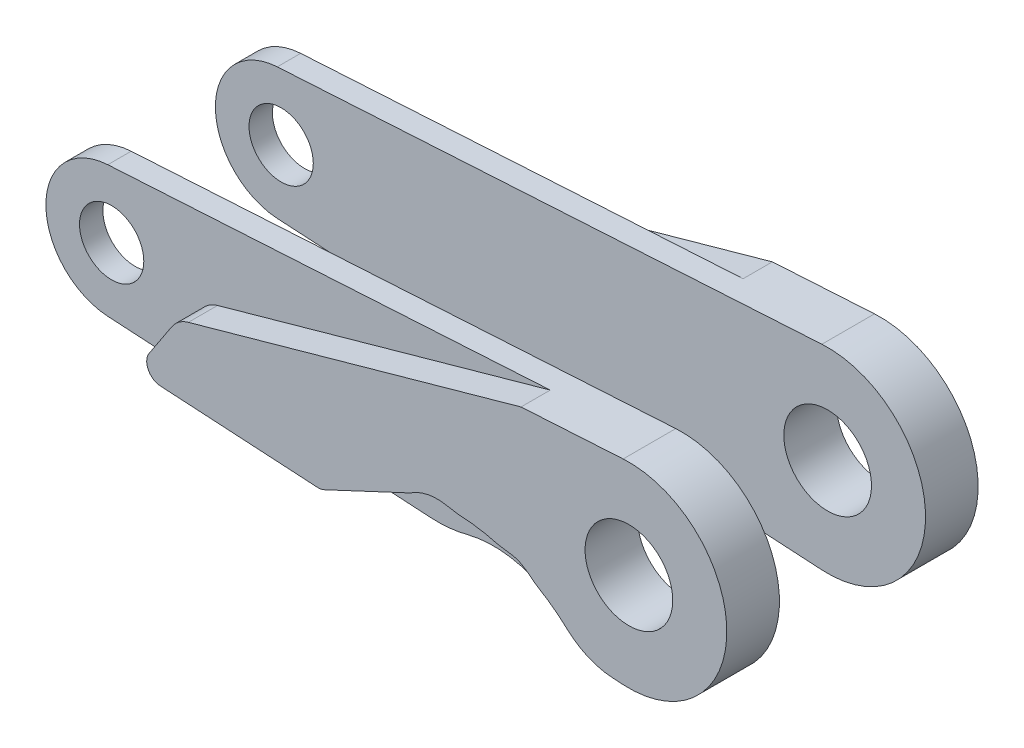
ISO-10303-21;
HEADER;
FILE_DESCRIPTION(('STEP AP214'),'2;1');
FILE_NAME('part.step','',(''),(''),'','','');
FILE_SCHEMA(('AUTOMOTIVE_DESIGN { 1 0 10303 214 1 1 1 1 }'));
ENDSEC;
DATA;
#1=APPLICATION_CONTEXT('core data for automotive mechanical design processes');
#2=APPLICATION_PROTOCOL_DEFINITION('international standard','automotive_design',2000,#1);
#3=PRODUCT_CONTEXT('',#1,'mechanical');
#4=PRODUCT('Part','Part','',(#3));
#5=PRODUCT_RELATED_PRODUCT_CATEGORY('part','',(#4));
#6=PRODUCT_DEFINITION_FORMATION('','',#4);
#7=PRODUCT_DEFINITION_CONTEXT('part definition',#1,'design');
#8=PRODUCT_DEFINITION('design','',#6,#7);
#9=PRODUCT_DEFINITION_SHAPE('','',#8);
#10=(LENGTH_UNIT() NAMED_UNIT(*) SI_UNIT(.MILLI.,.METRE.));
#11=(NAMED_UNIT(*) PLANE_ANGLE_UNIT() SI_UNIT($,.RADIAN.));
#12=(NAMED_UNIT(*) SI_UNIT($,.STERADIAN.) SOLID_ANGLE_UNIT());
#13=UNCERTAINTY_MEASURE_WITH_UNIT(LENGTH_MEASURE(1.E-05),#10,'distance_accuracy_value','');
#14=(GEOMETRIC_REPRESENTATION_CONTEXT(3) GLOBAL_UNCERTAINTY_ASSIGNED_CONTEXT((#13)) GLOBAL_UNIT_ASSIGNED_CONTEXT((#10,
#11,#12)) REPRESENTATION_CONTEXT('',''));
#15=CARTESIAN_POINT('',(0.,0.,0.));
#16=DIRECTION('',(0.,0.,1.));
#17=DIRECTION('',(1.,0.,0.));
#18=AXIS2_PLACEMENT_3D('',#15,#16,#17);
#19=CARTESIAN_POINT('',(-60.3114310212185,-68.7538061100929,113.112041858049));
#20=DIRECTION('',(0.,0.,-0.999999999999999));
#21=DIRECTION('',(1.,0.,0.));
#22=AXIS2_PLACEMENT_3D('',#19,#20,#21);
#23=CYLINDRICAL_SURFACE('',#22,57.5811728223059);
#24=CARTESIAN_POINT('',(-60.3114310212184,-68.7538061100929,-42.9999999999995));
#25=DIRECTION('',(0.,0.,0.999999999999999));
#26=DIRECTION('',(-1.,0.,0.));
#27=AXIS2_PLACEMENT_3D('',#24,#25,#26);
#28=CIRCLE('',#27,57.5811728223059);
#29=CARTESIAN_POINT('',(-44.724201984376,-13.3224994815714,-42.9999999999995));
#30=VERTEX_POINT('',#29);
#31=CARTESIAN_POINT('',(-58.1787622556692,-11.2121413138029,-42.9999999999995));
#32=VERTEX_POINT('',#31);
#33=EDGE_CURVE('P0_E232',#30,#32,#28,.T.);
#34=ORIENTED_EDGE('',*,*,#33,.F.);
#35=DIRECTION('',(0.,0.,-0.999999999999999));
#36=VECTOR('',#35,1.);
#37=CARTESIAN_POINT('',(-44.7242019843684,-13.3224994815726,-36.9999999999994));
#38=LINE('',#37,#36);
#39=CARTESIAN_POINT('',(-44.7242019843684,-13.3224994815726,-30.9999999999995));
#40=VERTEX_POINT('',#39);
#41=EDGE_CURVE('P0_E216',#40,#30,#38,.T.);
#42=ORIENTED_EDGE('',*,*,#41,.F.);
#43=CARTESIAN_POINT('',(-60.3114310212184,-68.7538061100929,-30.9999999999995));
#44=DIRECTION('',(0.,0.,0.999999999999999));
#45=DIRECTION('',(1.,0.,0.));
#46=AXIS2_PLACEMENT_3D('',#43,#44,#45);
#47=CIRCLE('',#46,57.5811728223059);
#48=CARTESIAN_POINT('',(-58.1787622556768,-11.2121413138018,-30.9999999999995));
#49=VERTEX_POINT('',#48);
#50=EDGE_CURVE('P0_E198',#49,#40,#47,.F.);
#51=ORIENTED_EDGE('',*,*,#50,.F.);
#52=DIRECTION('',(0.,0.,-0.999999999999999));
#53=VECTOR('',#52,1.);
#54=CARTESIAN_POINT('',(-58.1787622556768,-11.2121413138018,-36.9999999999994));
#55=LINE('',#54,#53);
#56=EDGE_CURVE('P0_E208',#32,#49,#55,.F.);
#57=ORIENTED_EDGE('',*,*,#56,.F.);
#58=EDGE_LOOP('',(#34,#42,#51,#57));
#59=FACE_BOUND('',#58,.T.);
#60=ADVANCED_FACE('P0_F16',(#59),#23,.F.);
#61=CARTESIAN_POINT('',(-21.1036808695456,-26.5833924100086,-42.9999999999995));
#62=VERTEX_POINT('',#61);
#63=CARTESIAN_POINT('',(-31.2037246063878,-19.0714864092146,-42.9999999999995));
#64=VERTEX_POINT('',#63);
#65=EDGE_CURVE('P0_E226',#62,#64,#28,.T.);
#66=ORIENTED_EDGE('',*,*,#65,.F.);
#67=DIRECTION('',(0.,0.,-0.999999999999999));
#68=VECTOR('',#67,1.);
#69=CARTESIAN_POINT('',(-21.1036808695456,-26.5833924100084,113.112041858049));
#70=LINE('',#69,#68);
#71=CARTESIAN_POINT('',(-21.1036808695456,-26.5833924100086,-30.9999999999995));
#72=VERTEX_POINT('',#71);
#73=EDGE_CURVE('P0_E331',#72,#62,#70,.T.);
#74=ORIENTED_EDGE('',*,*,#73,.F.);
#75=CARTESIAN_POINT('',(-31.2037246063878,-19.0714864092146,-30.9999999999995));
#76=VERTEX_POINT('',#75);
#77=EDGE_CURVE('P0_E220',#76,#72,#47,.F.);
#78=ORIENTED_EDGE('',*,*,#77,.F.);
#79=DIRECTION('',(0.,0.,-0.999999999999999));
#80=VECTOR('',#79,1.);
#81=CARTESIAN_POINT('',(-31.2037246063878,-19.0714864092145,113.112041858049));
#82=LINE('',#81,#80);
#83=EDGE_CURVE('P0_E353',#64,#76,#82,.F.);
#84=ORIENTED_EDGE('',*,*,#83,.F.);
#85=EDGE_LOOP('',(#66,#74,#78,#84));
#86=FACE_BOUND('',#85,.T.);
#87=ADVANCED_FACE('P0_F447',(#86),#23,.F.);
#88=CARTESIAN_POINT('',(-58.3200008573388,-63.,-34.9999999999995));
#89=DIRECTION('',(0.,0.,0.999999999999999));
#90=DIRECTION('',(-1.,0.,0.));
#91=AXIS2_PLACEMENT_3D('',#88,#89,#90);
#92=CYLINDRICAL_SURFACE('',#91,36.5);
#93=CARTESIAN_POINT('',(-58.3200008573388,-63.,-30.9999999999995));
#94=DIRECTION('',(0.,0.,0.999999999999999));
#95=DIRECTION('',(1.,0.,0.));
#96=AXIS2_PLACEMENT_3D('',#93,#94,#95);
#97=CIRCLE('',#96,36.5);
#98=CARTESIAN_POINT('',(-67.4390428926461,-27.6574891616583,-30.9999999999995));
#99=VERTEX_POINT('',#98);
#100=CARTESIAN_POINT('',(-45.1133238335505,-28.9730447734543,-30.9999999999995));
#101=VERTEX_POINT('',#100);
#102=EDGE_CURVE('P0_E219',#99,#101,#97,.F.);
#103=ORIENTED_EDGE('',*,*,#102,.T.);
#104=DIRECTION('',(0.,0.,0.999999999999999));
#105=VECTOR('',#104,1.);
#106=CARTESIAN_POINT('',(-45.1133238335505,-28.9730447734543,-34.9999999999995));
#107=LINE('',#106,#105);
#108=CARTESIAN_POINT('',(-45.1133238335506,-28.9730447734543,-24.9999999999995));
#109=VERTEX_POINT('',#108);
#110=EDGE_CURVE('P0_E312',#109,#101,#107,.F.);
#111=ORIENTED_EDGE('',*,*,#110,.F.);
#112=CARTESIAN_POINT('',(-58.3200008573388,-63.,-24.9999999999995));
#113=DIRECTION('',(0.,0.,-0.999999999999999));
#114=DIRECTION('',(-1.,0.,0.));
#115=AXIS2_PLACEMENT_3D('',#112,#113,#114);
#116=CIRCLE('',#115,36.5);
#117=CARTESIAN_POINT('',(-67.4390428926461,-27.6574891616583,-24.9999999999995));
#118=VERTEX_POINT('',#117);
#119=EDGE_CURVE('P0_E260',#118,#109,#116,.T.);
#120=ORIENTED_EDGE('',*,*,#119,.F.);
#121=DIRECTION('',(0.,0.,0.999999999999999));
#122=VECTOR('',#121,1.);
#123=CARTESIAN_POINT('',(-67.4390428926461,-27.6574891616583,-34.9999999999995));
#124=LINE('',#123,#122);
#125=EDGE_CURVE('P0_E315',#99,#118,#124,.T.);
#126=ORIENTED_EDGE('',*,*,#125,.F.);
#127=EDGE_LOOP('',(#103,#111,#120,#126));
#128=FACE_BOUND('',#127,.T.);
#129=ADVANCED_FACE('P0_F464',(#128),#92,.F.);
#130=CARTESIAN_POINT('',(-77.4325136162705,11.0740295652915,-34.9999999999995));
#131=DIRECTION('',(0.,0.,0.999999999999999));
#132=DIRECTION('',(-1.,0.,0.));
#133=AXIS2_PLACEMENT_3D('',#130,#131,#132);
#134=CYLINDRICAL_SURFACE('',#133,40.);
#135=ORIENTED_EDGE('',*,*,#125,.T.);
#136=CARTESIAN_POINT('',(-77.4325136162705,11.0740295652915,-24.9999999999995));
#137=DIRECTION('',(0.,0.,0.999999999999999));
#138=DIRECTION('',(1.,0.,0.));
#139=AXIS2_PLACEMENT_3D('',#136,#137,#138);
#140=CIRCLE('',#139,40.);
#141=CARTESIAN_POINT('',(-79.7854547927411,-28.8567063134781,-24.9999999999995));
#142=VERTEX_POINT('',#141);
#143=EDGE_CURVE('P0_E320',#118,#142,#140,.F.);
#144=ORIENTED_EDGE('',*,*,#143,.T.);
#145=DIRECTION('',(0.,0.,-0.999999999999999));
#146=VECTOR('',#145,1.);
#147=CARTESIAN_POINT('',(-79.785454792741,-28.8567063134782,-30.9999999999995));
#148=LINE('',#147,#146);
#149=CARTESIAN_POINT('',(-79.7854547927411,-28.8567063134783,-30.9999999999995));
#150=VERTEX_POINT('',#149);
#151=EDGE_CURVE('P0_E323',#142,#150,#148,.T.);
#152=ORIENTED_EDGE('',*,*,#151,.T.);
#153=CARTESIAN_POINT('',(-77.4325136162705,11.0740295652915,-30.9999999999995));
#154=DIRECTION('',(0.,0.,0.999999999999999));
#155=DIRECTION('',(1.,0.,0.));
#156=AXIS2_PLACEMENT_3D('',#153,#154,#155);
#157=CIRCLE('',#156,40.);
#158=EDGE_CURVE('P0_E235',#99,#150,#157,.F.);
#159=ORIENTED_EDGE('',*,*,#158,.F.);
#160=EDGE_LOOP('',(#135,#144,#152,#159));
#161=FACE_BOUND('',#160,.T.);
#162=ADVANCED_FACE('P0_F468',(#161),#134,.T.);
#163=CARTESIAN_POINT('',(-30.6402531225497,8.31676917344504,-34.9999999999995));
#164=DIRECTION('',(0.,0.,0.999999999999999));
#165=DIRECTION('',(-1.,0.,0.));
#166=AXIS2_PLACEMENT_3D('',#163,#164,#165);
#167=CYLINDRICAL_SURFACE('',#166,40.);
#168=DIRECTION('',(0.,0.,-0.999999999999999));
#169=VECTOR('',#168,1.);
#170=CARTESIAN_POINT('',(-32.9931942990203,-31.6139667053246,-24.9999999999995));
#171=LINE('',#170,#169);
#172=CARTESIAN_POINT('',(-32.9931942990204,-31.6139667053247,-30.9999999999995));
#173=VERTEX_POINT('',#172);
#174=CARTESIAN_POINT('',(-32.9931942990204,-31.6139667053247,-24.9999999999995));
#175=VERTEX_POINT('',#174);
#176=EDGE_CURVE('P0_E326',#173,#175,#171,.F.);
#177=ORIENTED_EDGE('',*,*,#176,.T.);
#178=CARTESIAN_POINT('',(-30.6402531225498,8.31676917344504,-24.9999999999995));
#179=DIRECTION('',(0.,0.,0.999999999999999));
#180=DIRECTION('',(1.,0.,0.));
#181=AXIS2_PLACEMENT_3D('',#178,#179,#180);
#182=CIRCLE('',#181,40.);
#183=EDGE_CURVE('P0_E318',#175,#109,#182,.F.);
#184=ORIENTED_EDGE('',*,*,#183,.T.);
#185=ORIENTED_EDGE('',*,*,#110,.T.);
#186=CARTESIAN_POINT('',(-30.6402531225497,8.31676917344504,-30.9999999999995));
#187=DIRECTION('',(0.,0.,0.999999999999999));
#188=DIRECTION('',(1.,0.,0.));
#189=AXIS2_PLACEMENT_3D('',#186,#187,#188);
#190=CIRCLE('',#189,40.);
#191=EDGE_CURVE('P0_E329',#173,#101,#190,.F.);
#192=ORIENTED_EDGE('',*,*,#191,.F.);
#193=EDGE_LOOP('',(#177,#184,#185,#192));
#194=FACE_BOUND('',#193,.T.);
#195=ADVANCED_FACE('P0_F458',(#194),#167,.T.);
#196=CARTESIAN_POINT('',(-1.97058823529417,-33.4419912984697,-22.9999999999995));
#197=DIRECTION('',(-0.0588235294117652,-0.998268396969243,0.));
#198=DIRECTION('',(0.998268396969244,-0.0588235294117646,0.));
#199=AXIS2_PLACEMENT_3D('',#196,#197,#198);
#200=PLANE('',#199);
#201=DIRECTION('',(-0.998268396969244,0.0588235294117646,0.));
#202=VECTOR('',#201,1.);
#203=CARTESIAN_POINT('',(-1.97058823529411,-33.4419912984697,-30.9999999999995));
#204=LINE('',#203,#202);
#205=CARTESIAN_POINT('',(-106.640171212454,-27.2742769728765,-30.9999999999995));
#206=VERTEX_POINT('',#205);
#207=EDGE_CURVE('P0_E238',#150,#206,#204,.T.);
#208=ORIENTED_EDGE('',*,*,#207,.F.);
#209=ORIENTED_EDGE('',*,*,#151,.F.);
#210=DIRECTION('',(0.998268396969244,-0.0588235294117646,0.));
#211=VECTOR('',#210,1.);
#212=CARTESIAN_POINT('',(-1.97058823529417,-33.4419912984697,-24.9999999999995));
#213=LINE('',#212,#211);
#214=CARTESIAN_POINT('',(-188.323529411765,-22.4610389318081,-24.9999999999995));
#215=VERTEX_POINT('',#214);
#216=EDGE_CURVE('P0_E304',#215,#142,#213,.T.);
#217=ORIENTED_EDGE('',*,*,#216,.F.);
#218=DIRECTION('',(0.,0.,-0.999999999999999));
#219=VECTOR('',#218,1.);
#220=CARTESIAN_POINT('',(-188.323529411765,-22.4610389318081,-22.9999999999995));
#221=LINE('',#220,#219);
#222=CARTESIAN_POINT('',(-188.323529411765,-22.4610389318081,-32.9999999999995));
#223=VERTEX_POINT('',#222);
#224=EDGE_CURVE('P0_E291',#215,#223,#221,.T.);
#225=ORIENTED_EDGE('',*,*,#224,.T.);
#226=DIRECTION('',(0.998268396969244,-0.0588235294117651,0.));
#227=VECTOR('',#226,1.);
#228=CARTESIAN_POINT('',(-188.323529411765,-22.4610389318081,-32.9999999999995));
#229=LINE('',#228,#227);
#230=CARTESIAN_POINT('',(-160.294117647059,-24.1126878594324,-32.9999999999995));
#231=VERTEX_POINT('',#230);
#232=EDGE_CURVE('P0_E229',#223,#231,#229,.T.);
#233=ORIENTED_EDGE('',*,*,#232,.T.);
#234=DIRECTION('',(0.,0.,0.999999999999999));
#235=VECTOR('',#234,1.);
#236=CARTESIAN_POINT('',(-160.294117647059,-24.1126878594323,-219.21593636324));
#237=LINE('',#236,#235);
#238=CARTESIAN_POINT('',(-160.294117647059,-24.1126878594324,-42.9999999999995));
#239=VERTEX_POINT('',#238);
#240=EDGE_CURVE('P0_E263',#239,#231,#237,.T.);
#241=ORIENTED_EDGE('',*,*,#240,.F.);
#242=DIRECTION('',(-0.998268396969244,0.0588235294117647,0.));
#243=VECTOR('',#242,1.);
#244=CARTESIAN_POINT('',(-1.97058823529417,-33.4419912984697,-42.9999999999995));
#245=LINE('',#244,#243);
#246=CARTESIAN_POINT('',(-106.640171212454,-27.2742769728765,-42.9999999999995));
#247=VERTEX_POINT('',#246);
#248=EDGE_CURVE('P0_E245',#247,#239,#245,.T.);
#249=ORIENTED_EDGE('',*,*,#248,.F.);
#250=DIRECTION('',(0.,0.,-0.999999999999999));
#251=VECTOR('',#250,1.);
#252=CARTESIAN_POINT('',(-106.640171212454,-27.2742769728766,-22.9999999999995));
#253=LINE('',#252,#251);
#254=EDGE_CURVE('P0_E379',#206,#247,#253,.T.);
#255=ORIENTED_EDGE('',*,*,#254,.F.);
#256=EDGE_LOOP('',(#208,#209,#217,#225,#233,#241,#249,#255));
#257=FACE_BOUND('',#256,.T.);
#258=ADVANCED_FACE('P0_F470',(#257),#200,.T.);
#259=CARTESIAN_POINT('',(-187.,0.,-22.9999999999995));
#260=DIRECTION('',(0.,0.,-0.999999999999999));
#261=DIRECTION('',(1.,0.,0.));
#262=AXIS2_PLACEMENT_3D('',#259,#260,#261);
#263=CYLINDRICAL_SURFACE('',#262,22.5);
#264=CARTESIAN_POINT('',(-187.,0.,-24.9999999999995));
#265=DIRECTION('',(0.,0.,0.999999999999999));
#266=DIRECTION('',(1.,0.,0.));
#267=AXIS2_PLACEMENT_3D('',#264,#265,#266);
#268=CIRCLE('',#267,22.5);
#269=CARTESIAN_POINT('',(-188.323529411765,22.461038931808,-24.9999999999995));
#270=VERTEX_POINT('',#269);
#271=EDGE_CURVE('P0_E310',#270,#215,#268,.T.);
#272=ORIENTED_EDGE('',*,*,#271,.F.);
#273=DIRECTION('',(0.,0.,-0.999999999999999));
#274=VECTOR('',#273,1.);
#275=CARTESIAN_POINT('',(-188.323529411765,22.461038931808,-22.9999999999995));
#276=LINE('',#275,#274);
#277=CARTESIAN_POINT('',(-188.323529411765,22.461038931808,-32.9999999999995));
#278=VERTEX_POINT('',#277);
#279=EDGE_CURVE('P0_E292',#270,#278,#276,.T.);
#280=ORIENTED_EDGE('',*,*,#279,.T.);
#281=CARTESIAN_POINT('',(-187.,0.,-32.9999999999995));
#282=DIRECTION('',(0.,0.,0.999999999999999));
#283=DIRECTION('',(1.,0.,0.));
#284=AXIS2_PLACEMENT_3D('',#281,#282,#283);
#285=CIRCLE('',#284,22.5);
#286=EDGE_CURVE('P0_E420',#278,#223,#285,.T.);
#287=ORIENTED_EDGE('',*,*,#286,.T.);
#288=ORIENTED_EDGE('',*,*,#224,.F.);
#289=EDGE_LOOP('',(#272,#280,#287,#288));
#290=FACE_BOUND('',#289,.T.);
#291=ADVANCED_FACE('P0_F497',(#290),#263,.T.);
#292=CARTESIAN_POINT('',(-1.97058823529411,33.4419912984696,-22.9999999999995));
#293=DIRECTION('',(-0.0588235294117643,0.998268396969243,0.));
#294=DIRECTION('',(-0.998268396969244,-0.0588235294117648,0.));
#295=AXIS2_PLACEMENT_3D('',#292,#293,#294);
#296=PLANE('',#295);
#297=ORIENTED_EDGE('',*,*,#279,.F.);
#298=DIRECTION('',(-0.998268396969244,-0.0588235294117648,0.));
#299=VECTOR('',#298,1.);
#300=CARTESIAN_POINT('',(-1.97058823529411,33.4419912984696,-24.9999999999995));
#301=LINE('',#300,#299);
#302=CARTESIAN_POINT('',(-1.97058823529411,33.4419912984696,-24.9999999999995));
#303=VERTEX_POINT('',#302);
#304=EDGE_CURVE('P0_E308',#303,#270,#301,.T.);
#305=ORIENTED_EDGE('',*,*,#304,.F.);
#306=DIRECTION('',(0.,0.,-0.999999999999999));
#307=VECTOR('',#306,1.);
#308=CARTESIAN_POINT('',(-1.97058823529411,33.4419912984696,-22.9999999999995));
#309=LINE('',#308,#307);
#310=CARTESIAN_POINT('',(-1.970588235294,33.4419912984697,-42.9999999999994));
#311=VERTEX_POINT('',#310);
#312=EDGE_CURVE('P0_E296',#303,#311,#309,.T.);
#313=ORIENTED_EDGE('',*,*,#312,.T.);
#314=DIRECTION('',(0.998268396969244,0.0588235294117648,0.));
#315=VECTOR('',#314,1.);
#316=CARTESIAN_POINT('',(-1.97058823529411,33.4419912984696,-42.9999999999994));
#317=LINE('',#316,#315);
#318=CARTESIAN_POINT('',(-36.9099821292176,31.3831677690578,-42.9999999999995));
#319=VERTEX_POINT('',#318);
#320=EDGE_CURVE('P0_E246',#319,#311,#317,.T.);
#321=ORIENTED_EDGE('',*,*,#320,.F.);
#322=DIRECTION('',(0.,0.,0.999999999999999));
#323=VECTOR('',#322,1.);
#324=CARTESIAN_POINT('',(-36.9099821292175,31.3831677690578,-219.21593636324));
#325=LINE('',#324,#323);
#326=CARTESIAN_POINT('',(-36.9099821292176,31.3831677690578,-32.9999999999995));
#327=VERTEX_POINT('',#326);
#328=EDGE_CURVE('P0_E241',#319,#327,#325,.T.);
#329=ORIENTED_EDGE('',*,*,#328,.T.);
#330=DIRECTION('',(-0.998268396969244,-0.0588235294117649,0.));
#331=VECTOR('',#330,1.);
#332=CARTESIAN_POINT('',(-36.9099821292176,31.3831677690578,-32.9999999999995));
#333=LINE('',#332,#331);
#334=EDGE_CURVE('P0_E419',#327,#278,#333,.T.);
#335=ORIENTED_EDGE('',*,*,#334,.T.);
#336=EDGE_LOOP('',(#297,#305,#313,#321,#329,#335));
#337=FACE_BOUND('',#336,.T.);
#338=ADVANCED_FACE('P0_F487',(#337),#296,.T.);
#339=CARTESIAN_POINT('',(0.,0.,-22.9999999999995));
#340=DIRECTION('',(0.,0.,-0.999999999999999));
#341=DIRECTION('',(1.,0.,0.));
#342=AXIS2_PLACEMENT_3D('',#339,#340,#341);
#343=CYLINDRICAL_SURFACE('',#342,33.5);
#344=ORIENTED_EDGE('',*,*,#312,.F.);
#345=CARTESIAN_POINT('',(0.,0.,-24.9999999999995));
#346=DIRECTION('',(0.,0.,0.999999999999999));
#347=DIRECTION('',(1.,0.,0.));
#348=AXIS2_PLACEMENT_3D('',#345,#346,#347);
#349=CIRCLE('',#348,33.5);
#350=CARTESIAN_POINT('',(-1.97058823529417,-33.4419912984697,-24.9999999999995));
#351=VERTEX_POINT('',#350);
#352=EDGE_CURVE('P0_E306',#351,#303,#349,.T.);
#353=ORIENTED_EDGE('',*,*,#352,.F.);
#354=DIRECTION('',(0.,0.,-0.999999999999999));
#355=VECTOR('',#354,1.);
#356=CARTESIAN_POINT('',(-1.97058823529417,-33.4419912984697,-22.9999999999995));
#357=LINE('',#356,#355);
#358=CARTESIAN_POINT('',(-1.97058823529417,-33.4419912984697,-42.9999999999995));
#359=VERTEX_POINT('',#358);
#360=EDGE_CURVE('P0_E299',#351,#359,#357,.T.);
#361=ORIENTED_EDGE('',*,*,#360,.T.);
#362=CARTESIAN_POINT('',(0.,0.,-42.9999999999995));
#363=DIRECTION('',(0.,0.,-0.999999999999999));
#364=DIRECTION('',(-1.,0.,0.));
#365=AXIS2_PLACEMENT_3D('',#362,#363,#364);
#366=CIRCLE('',#365,33.5);
#367=EDGE_CURVE('P0_E282',#311,#359,#366,.T.);
#368=ORIENTED_EDGE('',*,*,#367,.F.);
#369=EDGE_LOOP('',(#344,#353,#361,#368));
#370=FACE_BOUND('',#369,.T.);
#371=ADVANCED_FACE('P0_F492',(#370),#343,.T.);
#372=DIRECTION('',(-0.998268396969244,0.0588235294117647,0.));
#373=VECTOR('',#372,1.);
#374=CARTESIAN_POINT('',(-1.97058823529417,-33.4419912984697,-42.9999999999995));
#375=LINE('',#374,#373);
#376=CARTESIAN_POINT('',(-5.55145234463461,-33.2309868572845,-42.9999999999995));
#377=VERTEX_POINT('',#376);
#378=EDGE_CURVE('P0_E242',#359,#377,#375,.T.);
#379=ORIENTED_EDGE('',*,*,#378,.F.);
#380=ORIENTED_EDGE('',*,*,#360,.F.);
#381=EDGE_CURVE('P0_E295',#175,#351,#213,.T.);
#382=ORIENTED_EDGE('',*,*,#381,.F.);
#383=ORIENTED_EDGE('',*,*,#176,.F.);
#384=DIRECTION('',(-0.998268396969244,0.0588235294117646,0.));
#385=VECTOR('',#384,1.);
#386=CARTESIAN_POINT('',(-1.97058823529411,-33.4419912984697,-30.9999999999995));
#387=LINE('',#386,#385);
#388=CARTESIAN_POINT('',(-5.55145234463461,-33.2309868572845,-30.9999999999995));
#389=VERTEX_POINT('',#388);
#390=EDGE_CURVE('P0_E223',#389,#173,#387,.T.);
#391=ORIENTED_EDGE('',*,*,#390,.F.);
#392=DIRECTION('',(0.,0.,0.999999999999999));
#393=VECTOR('',#392,1.);
#394=CARTESIAN_POINT('',(-5.55145234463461,-33.2309868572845,-30.9999999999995));
#395=LINE('',#394,#393);
#396=EDGE_CURVE('P0_E336',#377,#389,#395,.T.);
#397=ORIENTED_EDGE('',*,*,#396,.F.);
#398=EDGE_LOOP('',(#379,#380,#382,#383,#391,#397));
#399=FACE_BOUND('',#398,.T.);
#400=ADVANCED_FACE('P0_F454',(#399),#200,.T.);
#401=CARTESIAN_POINT('',(0.,0.,-24.9999999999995));
#402=DIRECTION('',(0.,0.,-0.999999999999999));
#403=DIRECTION('',(1.,0.,0.));
#404=AXIS2_PLACEMENT_3D('',#401,#402,#403);
#405=PLANE('',#404);
#406=CARTESIAN_POINT('',(-187.,0.,-24.9999999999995));
#407=DIRECTION('',(0.,0.,0.999999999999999));
#408=DIRECTION('',(1.,0.,0.));
#409=AXIS2_PLACEMENT_3D('',#406,#407,#408);
#410=CIRCLE('',#409,11.);
#411=CARTESIAN_POINT('',(-176.,0.,-24.9999999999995));
#412=VERTEX_POINT('',#411);
#413=EDGE_CURVE('P0_E285',#412,#412,#410,.T.);
#414=ORIENTED_EDGE('',*,*,#413,.F.);
#415=EDGE_LOOP('',(#414));
#416=FACE_BOUND('',#415,.T.);
#417=CARTESIAN_POINT('',(0.,0.,-24.9999999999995));
#418=DIRECTION('',(0.,0.,0.999999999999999));
#419=DIRECTION('',(1.,0.,0.));
#420=AXIS2_PLACEMENT_3D('',#417,#418,#419);
#421=CIRCLE('',#420,15.);
#422=CARTESIAN_POINT('',(15.,0.,-24.9999999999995));
#423=VERTEX_POINT('',#422);
#424=EDGE_CURVE('P0_E288',#423,#423,#421,.T.);
#425=ORIENTED_EDGE('',*,*,#424,.F.);
#426=EDGE_LOOP('',(#425));
#427=FACE_BOUND('',#426,.T.);
#428=ORIENTED_EDGE('',*,*,#119,.T.);
#429=ORIENTED_EDGE('',*,*,#183,.F.);
#430=ORIENTED_EDGE('',*,*,#381,.T.);
#431=ORIENTED_EDGE('',*,*,#352,.T.);
#432=ORIENTED_EDGE('',*,*,#304,.T.);
#433=ORIENTED_EDGE('',*,*,#271,.T.);
#434=ORIENTED_EDGE('',*,*,#216,.T.);
#435=ORIENTED_EDGE('',*,*,#143,.F.);
#436=EDGE_LOOP('',(#428,#429,#430,#431,#432,#433,#434,#435));
#437=FACE_BOUND('',#436,.T.);
#438=ADVANCED_FACE('P0_F495',(#416,#427,#437),#405,.F.);
#439=CARTESIAN_POINT('',(0.,0.,-28.9999999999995));
#440=DIRECTION('',(0.,0.,-0.999999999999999));
#441=DIRECTION('',(1.,0.,0.));
#442=AXIS2_PLACEMENT_3D('',#439,#440,#441);
#443=CYLINDRICAL_SURFACE('',#442,15.);
#444=CARTESIAN_POINT('',(0.,0.,-42.9999999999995));
#445=DIRECTION('',(0.,0.,-0.999999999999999));
#446=DIRECTION('',(-1.,0.,0.));
#447=AXIS2_PLACEMENT_3D('',#444,#445,#446);
#448=CIRCLE('',#447,15.);
#449=CARTESIAN_POINT('',(15.,0.,-42.9999999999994));
#450=VERTEX_POINT('',#449);
#451=EDGE_CURVE('P0_E279',#450,#450,#448,.T.);
#452=CARTESIAN_POINT('',(15.,0.,-24.9999999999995));
#453=CARTESIAN_POINT('',(15.,0.,-25.1874999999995));
#454=CARTESIAN_POINT('',(15.,0.,-25.3749999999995));
#455=CARTESIAN_POINT('',(15.,0.,-25.7499999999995));
#456=CARTESIAN_POINT('',(15.,0.,-25.9374999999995));
#457=CARTESIAN_POINT('',(15.,0.,-26.3124999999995));
#458=CARTESIAN_POINT('',(15.,0.,-26.4999999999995));
#459=CARTESIAN_POINT('',(15.,0.,-26.8749999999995));
#460=CARTESIAN_POINT('',(15.,0.,-27.0624999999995));
#461=CARTESIAN_POINT('',(15.,0.,-27.4374999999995));
#462=CARTESIAN_POINT('',(15.,0.,-27.6249999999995));
#463=CARTESIAN_POINT('',(15.,0.,-27.9999999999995));
#464=CARTESIAN_POINT('',(15.,0.,-28.1874999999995));
#465=CARTESIAN_POINT('',(15.,0.,-28.5624999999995));
#466=CARTESIAN_POINT('',(15.,0.,-28.7499999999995));
#467=CARTESIAN_POINT('',(15.,0.,-29.1249999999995));
#468=CARTESIAN_POINT('',(15.,0.,-29.3124999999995));
#469=CARTESIAN_POINT('',(15.,0.,-29.6874999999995));
#470=CARTESIAN_POINT('',(15.,0.,-29.8749999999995));
#471=CARTESIAN_POINT('',(15.,0.,-30.2499999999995));
#472=CARTESIAN_POINT('',(15.,0.,-30.4374999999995));
#473=CARTESIAN_POINT('',(15.,0.,-30.8124999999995));
#474=CARTESIAN_POINT('',(15.,0.,-30.9999999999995));
#475=CARTESIAN_POINT('',(15.,0.,-31.3749999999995));
#476=CARTESIAN_POINT('',(15.,0.,-31.5624999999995));
#477=CARTESIAN_POINT('',(15.,0.,-31.9374999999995));
#478=CARTESIAN_POINT('',(15.,0.,-32.1249999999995));
#479=CARTESIAN_POINT('',(15.,0.,-32.4999999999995));
#480=CARTESIAN_POINT('',(15.,0.,-32.6874999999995));
#481=CARTESIAN_POINT('',(15.,0.,-33.0624999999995));
#482=CARTESIAN_POINT('',(15.,0.,-33.2499999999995));
#483=CARTESIAN_POINT('',(15.,0.,-33.6249999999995));
#484=CARTESIAN_POINT('',(15.,0.,-33.8124999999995));
#485=CARTESIAN_POINT('',(15.,0.,-34.1874999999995));
#486=CARTESIAN_POINT('',(15.,0.,-34.3749999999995));
#487=CARTESIAN_POINT('',(15.,0.,-34.7499999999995));
#488=CARTESIAN_POINT('',(15.,0.,-34.9374999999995));
#489=CARTESIAN_POINT('',(15.,0.,-35.3124999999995));
#490=CARTESIAN_POINT('',(15.,0.,-35.4999999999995));
#491=CARTESIAN_POINT('',(15.,0.,-35.8749999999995));
#492=CARTESIAN_POINT('',(15.,0.,-36.0624999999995));
#493=CARTESIAN_POINT('',(15.,0.,-36.4374999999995));
#494=CARTESIAN_POINT('',(15.,0.,-36.6249999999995));
#495=CARTESIAN_POINT('',(15.,0.,-36.9999999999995));
#496=CARTESIAN_POINT('',(15.,0.,-37.1874999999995));
#497=CARTESIAN_POINT('',(15.,0.,-37.5624999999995));
#498=CARTESIAN_POINT('',(15.,0.,-37.7499999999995));
#499=CARTESIAN_POINT('',(15.,0.,-38.1249999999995));
#500=CARTESIAN_POINT('',(15.,0.,-38.3124999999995));
#501=CARTESIAN_POINT('',(15.,0.,-38.6874999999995));
#502=CARTESIAN_POINT('',(15.,0.,-38.8749999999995));
#503=CARTESIAN_POINT('',(15.,0.,-39.2499999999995));
#504=CARTESIAN_POINT('',(15.,0.,-39.4374999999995));
#505=CARTESIAN_POINT('',(15.,0.,-39.8124999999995));
#506=CARTESIAN_POINT('',(15.,0.,-39.9999999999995));
#507=CARTESIAN_POINT('',(15.,0.,-40.3749999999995));
#508=CARTESIAN_POINT('',(15.,0.,-40.5624999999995));
#509=CARTESIAN_POINT('',(15.,0.,-40.9374999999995));
#510=CARTESIAN_POINT('',(15.,0.,-41.1249999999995));
#511=CARTESIAN_POINT('',(15.,0.,-41.4999999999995));
#512=CARTESIAN_POINT('',(15.,0.,-41.6874999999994));
#513=CARTESIAN_POINT('',(15.,0.,-42.0624999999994));
#514=CARTESIAN_POINT('',(15.,0.,-42.2499999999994));
#515=CARTESIAN_POINT('',(15.,0.,-42.6249999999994));
#516=CARTESIAN_POINT('',(15.,0.,-42.8124999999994));
#517=CARTESIAN_POINT('',(15.,0.,-42.9999999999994));
#518=B_SPLINE_CURVE_WITH_KNOTS('',3,(#452,#453,#454,#455,#456,#457,#458,#459,#460,#461,#462,
#463,#464,#465,#466,#467,#468,#469,#470,#471,#472,#473,#474,#475,#476,#477,#478,#479,#480,#481,
#482,#483,#484,#485,#486,#487,#488,#489,#490,#491,#492,#493,#494,#495,#496,#497,#498,#499,#500,
#501,#502,#503,#504,#505,#506,#507,#508,#509,#510,#511,#512,#513,#514,#515,#516,#517),
.UNSPECIFIED.,.F.,.F.,(4,2,2,2,2,2,2,2,2,2,2,2,2,2,2,2,2,2,2,2,2,2,2,2,2,2,2,2,2,2,2,2,4),(0.,
0.5625,1.125,1.6875,2.25,2.8125,3.375,3.9375,4.49999999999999,5.06249999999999,5.62499999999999,
6.18749999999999,6.74999999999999,7.31249999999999,7.87499999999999,8.43749999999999,
8.99999999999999,9.56249999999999,10.125,10.6875,11.25,11.8125,12.375,12.9375,13.5,14.0625,
14.625,15.1875,15.75,16.3125,16.875,17.4375,18.),.UNSPECIFIED.);
#519=EDGE_CURVE('P0_BSEAM532',#423,#450,#518,.T.);
#520=ORIENTED_EDGE('',*,*,#424,.T.);
#521=ORIENTED_EDGE('',*,*,#451,.T.);
#522=ORIENTED_EDGE('',*,*,#519,.T.);
#523=ORIENTED_EDGE('',*,*,#519,.F.);
#524=EDGE_LOOP('',(#520,#522,#521,#523));
#525=FACE_BOUND('',#524,.T.);
#526=ADVANCED_FACE('P0_F532',(#525),#443,.F.);
#527=CARTESIAN_POINT('',(-187.,0.,-28.9999999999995));
#528=DIRECTION('',(0.,0.,-0.999999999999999));
#529=DIRECTION('',(1.,0.,0.));
#530=AXIS2_PLACEMENT_3D('',#527,#528,#529);
#531=CYLINDRICAL_SURFACE('',#530,11.);
#532=CARTESIAN_POINT('',(-187.,0.,-32.9999999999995));
#533=DIRECTION('',(0.,0.,0.999999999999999));
#534=DIRECTION('',(1.,0.,0.));
#535=AXIS2_PLACEMENT_3D('',#532,#533,#534);
#536=CIRCLE('',#535,11.);
#537=CARTESIAN_POINT('',(-176.,0.,-32.9999999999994));
#538=VERTEX_POINT('',#537);
#539=EDGE_CURVE('P0_E215',#538,#538,#536,.T.);
#540=CARTESIAN_POINT('',(-176.,0.,-24.9999999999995));
#541=CARTESIAN_POINT('',(-176.,0.,-25.0833333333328));
#542=CARTESIAN_POINT('',(-176.,0.,-25.1666666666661));
#543=CARTESIAN_POINT('',(-176.,0.,-25.3333333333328));
#544=CARTESIAN_POINT('',(-176.,0.,-25.4166666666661));
#545=CARTESIAN_POINT('',(-176.,0.,-25.5833333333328));
#546=CARTESIAN_POINT('',(-176.,0.,-25.6666666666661));
#547=CARTESIAN_POINT('',(-176.,0.,-25.8333333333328));
#548=CARTESIAN_POINT('',(-176.,0.,-25.9166666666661));
#549=CARTESIAN_POINT('',(-176.,0.,-26.0833333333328));
#550=CARTESIAN_POINT('',(-176.,0.,-26.1666666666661));
#551=CARTESIAN_POINT('',(-176.,0.,-26.3333333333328));
#552=CARTESIAN_POINT('',(-176.,0.,-26.4166666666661));
#553=CARTESIAN_POINT('',(-176.,0.,-26.5833333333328));
#554=CARTESIAN_POINT('',(-176.,0.,-26.6666666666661));
#555=CARTESIAN_POINT('',(-176.,0.,-26.8333333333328));
#556=CARTESIAN_POINT('',(-176.,0.,-26.9166666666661));
#557=CARTESIAN_POINT('',(-176.,0.,-27.0833333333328));
#558=CARTESIAN_POINT('',(-176.,0.,-27.1666666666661));
#559=CARTESIAN_POINT('',(-176.,0.,-27.3333333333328));
#560=CARTESIAN_POINT('',(-176.,0.,-27.4166666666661));
#561=CARTESIAN_POINT('',(-176.,0.,-27.5833333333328));
#562=CARTESIAN_POINT('',(-176.,0.,-27.6666666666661));
#563=CARTESIAN_POINT('',(-176.,0.,-27.8333333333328));
#564=CARTESIAN_POINT('',(-176.,0.,-27.9166666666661));
#565=CARTESIAN_POINT('',(-176.,0.,-28.0833333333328));
#566=CARTESIAN_POINT('',(-176.,0.,-28.1666666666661));
#567=CARTESIAN_POINT('',(-176.,0.,-28.3333333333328));
#568=CARTESIAN_POINT('',(-176.,0.,-28.4166666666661));
#569=CARTESIAN_POINT('',(-176.,0.,-28.5833333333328));
#570=CARTESIAN_POINT('',(-176.,0.,-28.6666666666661));
#571=CARTESIAN_POINT('',(-176.,0.,-28.8333333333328));
#572=CARTESIAN_POINT('',(-176.,0.,-28.9166666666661));
#573=CARTESIAN_POINT('',(-176.,0.,-29.0833333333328));
#574=CARTESIAN_POINT('',(-176.,0.,-29.1666666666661));
#575=CARTESIAN_POINT('',(-176.,0.,-29.3333333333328));
#576=CARTESIAN_POINT('',(-176.,0.,-29.4166666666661));
#577=CARTESIAN_POINT('',(-176.,0.,-29.5833333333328));
#578=CARTESIAN_POINT('',(-176.,0.,-29.6666666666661));
#579=CARTESIAN_POINT('',(-176.,0.,-29.8333333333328));
#580=CARTESIAN_POINT('',(-176.,0.,-29.9166666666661));
#581=CARTESIAN_POINT('',(-176.,0.,-30.0833333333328));
#582=CARTESIAN_POINT('',(-176.,0.,-30.1666666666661));
#583=CARTESIAN_POINT('',(-176.,0.,-30.3333333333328));
#584=CARTESIAN_POINT('',(-176.,0.,-30.4166666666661));
#585=CARTESIAN_POINT('',(-176.,0.,-30.5833333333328));
#586=CARTESIAN_POINT('',(-176.,0.,-30.6666666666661));
#587=CARTESIAN_POINT('',(-176.,0.,-30.8333333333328));
#588=CARTESIAN_POINT('',(-176.,0.,-30.9166666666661));
#589=CARTESIAN_POINT('',(-176.,0.,-31.0833333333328));
#590=CARTESIAN_POINT('',(-176.,0.,-31.1666666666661));
#591=CARTESIAN_POINT('',(-176.,0.,-31.3333333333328));
#592=CARTESIAN_POINT('',(-176.,0.,-31.4166666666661));
#593=CARTESIAN_POINT('',(-176.,0.,-31.5833333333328));
#594=CARTESIAN_POINT('',(-176.,0.,-31.6666666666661));
#595=CARTESIAN_POINT('',(-176.,0.,-31.8333333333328));
#596=CARTESIAN_POINT('',(-176.,0.,-31.9166666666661));
#597=CARTESIAN_POINT('',(-176.,0.,-32.0833333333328));
#598=CARTESIAN_POINT('',(-176.,0.,-32.1666666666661));
#599=CARTESIAN_POINT('',(-176.,0.,-32.3333333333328));
#600=CARTESIAN_POINT('',(-176.,0.,-32.4166666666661));
#601=CARTESIAN_POINT('',(-176.,0.,-32.5833333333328));
#602=CARTESIAN_POINT('',(-176.,0.,-32.6666666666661));
#603=CARTESIAN_POINT('',(-176.,0.,-32.8333333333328));
#604=CARTESIAN_POINT('',(-176.,0.,-32.9166666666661));
#605=CARTESIAN_POINT('',(-176.,0.,-32.9999999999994));
#606=B_SPLINE_CURVE_WITH_KNOTS('',3,(#540,#541,#542,#543,#544,#545,#546,#547,#548,#549,#550,
#551,#552,#553,#554,#555,#556,#557,#558,#559,#560,#561,#562,#563,#564,#565,#566,#567,#568,#569,
#570,#571,#572,#573,#574,#575,#576,#577,#578,#579,#580,#581,#582,#583,#584,#585,#586,#587,#588,
#589,#590,#591,#592,#593,#594,#595,#596,#597,#598,#599,#600,#601,#602,#603,#604,#605),
.UNSPECIFIED.,.F.,.F.,(4,2,2,2,2,2,2,2,2,2,2,2,2,2,2,2,2,2,2,2,2,2,2,2,2,2,2,2,2,2,2,2,4),(0.,
0.249999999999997,0.499999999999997,0.749999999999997,0.999999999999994,1.24999999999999,
1.49999999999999,1.74999999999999,1.99999999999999,2.24999999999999,2.49999999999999,
2.74999999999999,2.99999999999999,3.24999999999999,3.49999999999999,3.74999999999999,
3.99999999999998,4.24999999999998,4.49999999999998,4.74999999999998,4.99999999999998,
5.24999999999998,5.49999999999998,5.74999999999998,5.99999999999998,6.24999999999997,
6.49999999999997,6.74999999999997,6.99999999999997,7.24999999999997,7.49999999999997,
7.74999999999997,7.99999999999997),.UNSPECIFIED.);
#607=EDGE_CURVE('P0_BSEAM528',#412,#538,#606,.T.);
#608=ORIENTED_EDGE('',*,*,#413,.T.);
#609=ORIENTED_EDGE('',*,*,#539,.F.);
#610=ORIENTED_EDGE('',*,*,#607,.T.);
#611=ORIENTED_EDGE('',*,*,#607,.F.);
#612=EDGE_LOOP('',(#608,#610,#609,#611));
#613=FACE_BOUND('',#612,.T.);
#614=ADVANCED_FACE('P0_F528',(#613),#531,.F.);
#615=CARTESIAN_POINT('',(0.,0.,-42.9999999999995));
#616=DIRECTION('',(0.,0.,0.999999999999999));
#617=DIRECTION('',(-1.,0.,0.));
#618=AXIS2_PLACEMENT_3D('',#615,#616,#617);
#619=PLANE('',#618);
#620=ORIENTED_EDGE('',*,*,#451,.F.);
#621=EDGE_LOOP('',(#620));
#622=FACE_BOUND('',#621,.T.);
#623=ORIENTED_EDGE('',*,*,#248,.T.);
#624=CARTESIAN_POINT('',(-160.,-19.1213458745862,-42.9999999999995));
#625=DIRECTION('',(0.,0.,-0.999999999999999));
#626=DIRECTION('',(-1.,0.,0.));
#627=AXIS2_PLACEMENT_3D('',#624,#625,#626);
#628=CIRCLE('',#627,5.);
#629=CARTESIAN_POINT('',(-164.175570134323,-16.3709615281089,-42.9999999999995));
#630=VERTEX_POINT('',#629);
#631=EDGE_CURVE('P0_E249',#630,#239,#628,.F.);
#632=ORIENTED_EDGE('',*,*,#631,.F.);
#633=DIRECTION('',(-0.550076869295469,-0.835114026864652,0.));
#634=VECTOR('',#633,1.);
#635=CARTESIAN_POINT('',(-106.978135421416,70.4648657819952,-42.9999999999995));
#636=LINE('',#635,#634);
#637=CARTESIAN_POINT('',(-156.417883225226,-4.59342003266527,-42.9999999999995));
#638=VERTEX_POINT('',#637);
#639=EDGE_CURVE('P0_E251',#638,#630,#636,.T.);
#640=ORIENTED_EDGE('',*,*,#639,.F.);
#641=CARTESIAN_POINT('',(-148.06674295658,-10.09418872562,-42.9999999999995));
#642=DIRECTION('',(0.,0.,-0.999999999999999));
#643=DIRECTION('',(-1.,0.,0.));
#644=AXIS2_PLACEMENT_3D('',#641,#642,#643);
#645=CIRCLE('',#644,10.);
#646=CARTESIAN_POINT('',(-150.76059955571,-0.463864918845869,-42.9999999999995));
#647=VERTEX_POINT('',#646);
#648=EDGE_CURVE('P0_E254',#638,#647,#645,.T.);
#649=ORIENTED_EDGE('',*,*,#648,.T.);
#650=DIRECTION('',(-0.963032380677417,-0.269385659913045,0.));
#651=VECTOR('',#650,1.);
#652=CARTESIAN_POINT('',(-10.8201515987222,38.6811842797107,-42.9999999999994));
#653=LINE('',#652,#651);
#654=EDGE_CURVE('P0_E257',#319,#647,#653,.T.);
#655=ORIENTED_EDGE('',*,*,#654,.F.);
#656=ORIENTED_EDGE('',*,*,#320,.T.);
#657=ORIENTED_EDGE('',*,*,#367,.T.);
#658=ORIENTED_EDGE('',*,*,#378,.T.);
#659=CARTESIAN_POINT('',(-4.0808641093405,-8.27427693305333,-42.9999999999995));
#660=DIRECTION('',(0.,0.,-0.999999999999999));
#661=DIRECTION('',(-1.,0.,0.));
#662=AXIS2_PLACEMENT_3D('',#659,#660,#661);
#663=CIRCLE('',#662,25.);
#664=EDGE_CURVE('P0_E334',#62,#377,#663,.F.);
#665=ORIENTED_EDGE('',*,*,#664,.F.);
#666=ORIENTED_EDGE('',*,*,#65,.T.);
#667=CARTESIAN_POINT('',(-26.1486510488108,-10.4432634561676,-42.9999999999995));
#668=DIRECTION('',(0.,0.,-0.999999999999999));
#669=DIRECTION('',(-1.,0.,0.));
#670=AXIS2_PLACEMENT_3D('',#667,#668,#669);
#671=CIRCLE('',#670,10.);
#672=CARTESIAN_POINT('',(-32.6411426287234,-18.0490213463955,-42.9999999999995));
#673=VERTEX_POINT('',#672);
#674=EDGE_CURVE('P0_E351',#673,#64,#671,.F.);
#675=ORIENTED_EDGE('',*,*,#674,.F.);
#676=CARTESIAN_POINT('',(-50.8099444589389,-39.3332242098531,-42.9999999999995));
#677=DIRECTION('',(0.,0.,0.999999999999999));
#678=DIRECTION('',(-1.,0.,0.));
#679=AXIS2_PLACEMENT_3D('',#676,#677,#678);
#680=CIRCLE('',#679,27.9843286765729);
#681=CARTESIAN_POINT('',(-36.4039419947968,-15.3417727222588,-42.9999999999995));
#682=VERTEX_POINT('',#681);
#683=EDGE_CURVE('P0_E401',#673,#682,#680,.T.);
#684=ORIENTED_EDGE('',*,*,#683,.T.);
#685=CARTESIAN_POINT('',(-41.5518240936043,-23.9149465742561,-42.9999999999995));
#686=DIRECTION('',(0.,0.,-0.999999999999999));
#687=DIRECTION('',(-1.,0.,0.));
#688=AXIS2_PLACEMENT_3D('',#685,#686,#687);
#689=CIRCLE('',#688,10.);
#690=CARTESIAN_POINT('',(-40.073086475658,-14.0248841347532,-42.9999999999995));
#691=VERTEX_POINT('',#690);
#692=EDGE_CURVE('P0_E375',#691,#682,#689,.T.);
#693=ORIENTED_EDGE('',*,*,#692,.F.);
#694=CARTESIAN_POINT('',(197.541544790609,1575.18439223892,-42.9999999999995));
#695=DIRECTION('',(0.,0.,-0.999999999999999));
#696=DIRECTION('',(1.,0.,0.));
#697=AXIS2_PLACEMENT_3D('',#694,#695,#696);
#698=CIRCLE('',#697,1606.87486666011);
#699=EDGE_CURVE('P0_E397',#691,#30,#698,.T.);
#700=ORIENTED_EDGE('',*,*,#699,.T.);
#701=ORIENTED_EDGE('',*,*,#33,.T.);
#702=CARTESIAN_POINT('',(-62.4053134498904,-10.5250603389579,-42.9999999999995));
#703=VERTEX_POINT('',#702);
#704=EDGE_CURVE('P0_E211',#32,#703,#698,.T.);
#705=ORIENTED_EDGE('',*,*,#704,.T.);
#706=CARTESIAN_POINT('',(-60.7875965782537,-0.656778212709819,-42.9999999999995));
#707=DIRECTION('',(0.,0.,-0.999999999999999));
#708=DIRECTION('',(-1.,0.,0.));
#709=AXIS2_PLACEMENT_3D('',#706,#707,#708);
#710=CIRCLE('',#709,10.);
#711=CARTESIAN_POINT('',(-62.6198050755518,-10.4874959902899,-42.9999999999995));
#712=VERTEX_POINT('',#711);
#713=EDGE_CURVE('P0_E345',#712,#703,#710,.F.);
#714=ORIENTED_EDGE('',*,*,#713,.F.);
#715=CARTESIAN_POINT('',(-65.5978653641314,-26.4662834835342,-42.9999999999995));
#716=DIRECTION('',(0.,0.,0.999999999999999));
#717=DIRECTION('',(-1.,0.,0.));
#718=AXIS2_PLACEMENT_3D('',#715,#716,#717);
#719=CIRCLE('',#718,16.2539377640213);
#720=CARTESIAN_POINT('',(-74.2428936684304,-12.7020552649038,-42.9999999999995));
#721=VERTEX_POINT('',#720);
#722=EDGE_CURVE('P0_E393',#712,#721,#719,.T.);
#723=ORIENTED_EDGE('',*,*,#722,.T.);
#724=CARTESIAN_POINT('',(-79.5616222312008,-4.2338130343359,-42.9999999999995));
#725=DIRECTION('',(0.,0.,-0.999999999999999));
#726=DIRECTION('',(-1.,0.,0.));
#727=AXIS2_PLACEMENT_3D('',#724,#725,#726);
#728=CIRCLE('',#727,10.);
#729=CARTESIAN_POINT('',(-75.324515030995,-13.2917886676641,-42.9999999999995));
#730=VERTEX_POINT('',#729);
#731=EDGE_CURVE('P0_E348',#730,#721,#728,.F.);
#732=ORIENTED_EDGE('',*,*,#731,.F.);
#733=DIRECTION('',(0.905797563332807,0.42371072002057,0.));
#734=VECTOR('',#733,1.);
#735=CARTESIAN_POINT('',(-105.375249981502,-27.3488131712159,-42.9999999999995));
#736=LINE('',#735,#734);
#737=CARTESIAN_POINT('',(-104.227499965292,-26.8119228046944,-42.9999999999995));
#738=VERTEX_POINT('',#737);
#739=EDGE_CURVE('P0_E388',#738,#730,#736,.T.);
#740=ORIENTED_EDGE('',*,*,#739,.F.);
#741=CARTESIAN_POINT('',(-106.346053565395,-22.2829349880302,-42.9999999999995));
#742=DIRECTION('',(0.,0.,-0.999999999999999));
#743=DIRECTION('',(-1.,0.,0.));
#744=AXIS2_PLACEMENT_3D('',#741,#742,#743);
#745=CIRCLE('',#744,5.);
#746=EDGE_CURVE('P0_E382',#247,#738,#745,.F.);
#747=ORIENTED_EDGE('',*,*,#746,.F.);
#748=EDGE_LOOP('',(#623,#632,#640,#649,#655,#656,#657,#658,#665,#666,#675,#684,#693,#700,#701,
#705,#714,#723,#732,#740,#747));
#749=FACE_BOUND('',#748,.T.);
#750=ADVANCED_FACE('P0_F389',(#622,#749),#619,.F.);
#751=CARTESIAN_POINT('',(-160.,-19.1213458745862,-219.21593636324));
#752=DIRECTION('',(0.,0.,0.999999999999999));
#753=DIRECTION('',(-1.,0.,0.));
#754=AXIS2_PLACEMENT_3D('',#751,#752,#753);
#755=CYLINDRICAL_SURFACE('',#754,5.);
#756=CARTESIAN_POINT('',(-160.,-19.1213458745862,-32.9999999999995));
#757=DIRECTION('',(0.,0.,-0.999999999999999));
#758=DIRECTION('',(1.,0.,0.));
#759=AXIS2_PLACEMENT_3D('',#756,#757,#758);
#760=CIRCLE('',#759,5.);
#761=CARTESIAN_POINT('',(-164.175570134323,-16.3709615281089,-32.9999999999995));
#762=VERTEX_POINT('',#761);
#763=EDGE_CURVE('P0_E408',#231,#762,#760,.T.);
#764=ORIENTED_EDGE('',*,*,#763,.T.);
#765=DIRECTION('',(0.,0.,0.999999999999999));
#766=VECTOR('',#765,1.);
#767=CARTESIAN_POINT('',(-164.175570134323,-16.3709615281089,-219.21593636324));
#768=LINE('',#767,#766);
#769=EDGE_CURVE('P0_E266',#630,#762,#768,.T.);
#770=ORIENTED_EDGE('',*,*,#769,.F.);
#771=ORIENTED_EDGE('',*,*,#631,.T.);
#772=ORIENTED_EDGE('',*,*,#240,.T.);
#773=EDGE_LOOP('',(#764,#770,#771,#772));
#774=FACE_BOUND('',#773,.T.);
#775=ADVANCED_FACE('P0_F474',(#774),#755,.T.);
#776=CARTESIAN_POINT('',(-106.978135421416,70.4648657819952,-219.21593636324));
#777=DIRECTION('',(-0.835114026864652,0.550076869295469,0.));
#778=DIRECTION('',(-0.550076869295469,-0.835114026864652,0.));
#779=AXIS2_PLACEMENT_3D('',#776,#777,#778);
#780=PLANE('',#779);
#781=DIRECTION('',(0.550076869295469,0.835114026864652,0.));
#782=VECTOR('',#781,1.);
#783=CARTESIAN_POINT('',(-164.175570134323,-16.3709615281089,-32.9999999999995));
#784=LINE('',#783,#782);
#785=CARTESIAN_POINT('',(-156.417883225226,-4.59342003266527,-32.9999999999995));
#786=VERTEX_POINT('',#785);
#787=EDGE_CURVE('P0_E411',#762,#786,#784,.T.);
#788=ORIENTED_EDGE('',*,*,#787,.T.);
#789=DIRECTION('',(0.,0.,0.999999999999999));
#790=VECTOR('',#789,1.);
#791=CARTESIAN_POINT('',(-156.417883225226,-4.59342003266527,-219.21593636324));
#792=LINE('',#791,#790);
#793=EDGE_CURVE('P0_E269',#638,#786,#792,.T.);
#794=ORIENTED_EDGE('',*,*,#793,.F.);
#795=ORIENTED_EDGE('',*,*,#639,.T.);
#796=ORIENTED_EDGE('',*,*,#769,.T.);
#797=EDGE_LOOP('',(#788,#794,#795,#796));
#798=FACE_BOUND('',#797,.T.);
#799=ADVANCED_FACE('P0_F476',(#798),#780,.T.);
#800=CARTESIAN_POINT('',(-148.06674295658,-10.09418872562,-219.21593636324));
#801=DIRECTION('',(0.,0.,0.999999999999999));
#802=DIRECTION('',(-1.,0.,0.));
#803=AXIS2_PLACEMENT_3D('',#800,#801,#802);
#804=CYLINDRICAL_SURFACE('',#803,10.);
#805=DIRECTION('',(0.,0.,0.999999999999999));
#806=VECTOR('',#805,1.);
#807=CARTESIAN_POINT('',(-150.76059955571,-0.463864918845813,-219.21593636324));
#808=LINE('',#807,#806);
#809=CARTESIAN_POINT('',(-150.76059955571,-0.463864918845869,-32.9999999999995));
#810=VERTEX_POINT('',#809);
#811=EDGE_CURVE('P0_E272',#647,#810,#808,.T.);
#812=ORIENTED_EDGE('',*,*,#811,.F.);
#813=ORIENTED_EDGE('',*,*,#648,.F.);
#814=ORIENTED_EDGE('',*,*,#793,.T.);
#815=CARTESIAN_POINT('',(-148.06674295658,-10.09418872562,-32.9999999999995));
#816=DIRECTION('',(0.,0.,-0.999999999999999));
#817=DIRECTION('',(1.,0.,0.));
#818=AXIS2_PLACEMENT_3D('',#815,#816,#817);
#819=CIRCLE('',#818,10.);
#820=EDGE_CURVE('P0_E414',#786,#810,#819,.T.);
#821=ORIENTED_EDGE('',*,*,#820,.T.);
#822=EDGE_LOOP('',(#812,#813,#814,#821));
#823=FACE_BOUND('',#822,.T.);
#824=ADVANCED_FACE('P0_F479',(#823),#804,.T.);
#825=CARTESIAN_POINT('',(-10.820151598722,38.6811842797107,-219.21593636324));
#826=DIRECTION('',(-0.269385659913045,0.963032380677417,0.));
#827=DIRECTION('',(-0.963032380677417,-0.269385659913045,0.));
#828=AXIS2_PLACEMENT_3D('',#825,#826,#827);
#829=PLANE('',#828);
#830=DIRECTION('',(0.963032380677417,0.269385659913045,0.));
#831=VECTOR('',#830,1.);
#832=CARTESIAN_POINT('',(-150.76059955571,-0.463864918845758,-32.9999999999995));
#833=LINE('',#832,#831);
#834=EDGE_CURVE('P0_E417',#810,#327,#833,.T.);
#835=ORIENTED_EDGE('',*,*,#834,.T.);
#836=ORIENTED_EDGE('',*,*,#328,.F.);
#837=ORIENTED_EDGE('',*,*,#654,.T.);
#838=ORIENTED_EDGE('',*,*,#811,.T.);
#839=EDGE_LOOP('',(#835,#836,#837,#838));
#840=FACE_BOUND('',#839,.T.);
#841=ADVANCED_FACE('P0_F483',(#840),#829,.T.);
#842=CARTESIAN_POINT('',(0.,0.,-30.9999999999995));
#843=DIRECTION('',(0.,0.,-0.999999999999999));
#844=DIRECTION('',(1.,0.,0.));
#845=AXIS2_PLACEMENT_3D('',#842,#843,#844);
#846=PLANE('',#845);
#847=CARTESIAN_POINT('',(-50.8099444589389,-39.3332242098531,-30.9999999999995));
#848=DIRECTION('',(0.,0.,0.999999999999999));
#849=DIRECTION('',(1.,0.,0.));
#850=AXIS2_PLACEMENT_3D('',#847,#848,#849);
#851=CIRCLE('',#850,27.9843286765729);
#852=CARTESIAN_POINT('',(-36.4039419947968,-15.3417727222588,-30.9999999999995));
#853=VERTEX_POINT('',#852);
#854=CARTESIAN_POINT('',(-32.6411426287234,-18.0490213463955,-30.9999999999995));
#855=VERTEX_POINT('',#854);
#856=EDGE_CURVE('P0_E396',#853,#855,#851,.F.);
#857=ORIENTED_EDGE('',*,*,#856,.T.);
#858=CARTESIAN_POINT('',(-26.1486510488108,-10.4432634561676,-30.9999999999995));
#859=DIRECTION('',(0.,0.,0.999999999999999));
#860=DIRECTION('',(1.,0.,0.));
#861=AXIS2_PLACEMENT_3D('',#858,#859,#860);
#862=CIRCLE('',#861,10.);
#863=EDGE_CURVE('P0_E369',#76,#855,#862,.F.);
#864=ORIENTED_EDGE('',*,*,#863,.F.);
#865=ORIENTED_EDGE('',*,*,#77,.T.);
#866=CARTESIAN_POINT('',(-4.0808641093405,-8.27427693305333,-30.9999999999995));
#867=DIRECTION('',(0.,0.,0.999999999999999));
#868=DIRECTION('',(1.,0.,0.));
#869=AXIS2_PLACEMENT_3D('',#866,#867,#868);
#870=CIRCLE('',#869,25.);
#871=EDGE_CURVE('P0_E339',#389,#72,#870,.F.);
#872=ORIENTED_EDGE('',*,*,#871,.F.);
#873=ORIENTED_EDGE('',*,*,#390,.T.);
#874=ORIENTED_EDGE('',*,*,#191,.T.);
#875=ORIENTED_EDGE('',*,*,#102,.F.);
#876=ORIENTED_EDGE('',*,*,#158,.T.);
#877=ORIENTED_EDGE('',*,*,#207,.T.);
#878=CARTESIAN_POINT('',(-106.346053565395,-22.2829349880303,-30.9999999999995));
#879=DIRECTION('',(0.,0.,0.999999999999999));
#880=DIRECTION('',(1.,0.,0.));
#881=AXIS2_PLACEMENT_3D('',#878,#879,#880);
#882=CIRCLE('',#881,5.);
#883=CARTESIAN_POINT('',(-104.227499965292,-26.8119228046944,-30.9999999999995));
#884=VERTEX_POINT('',#883);
#885=EDGE_CURVE('P0_E11',#884,#206,#882,.F.);
#886=ORIENTED_EDGE('',*,*,#885,.F.);
#887=DIRECTION('',(-0.905797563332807,-0.42371072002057,0.));
#888=VECTOR('',#887,1.);
#889=CARTESIAN_POINT('',(-105.375249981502,-27.3488131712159,-30.9999999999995));
#890=LINE('',#889,#888);
#891=CARTESIAN_POINT('',(-75.324515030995,-13.2917886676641,-30.9999999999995));
#892=VERTEX_POINT('',#891);
#893=EDGE_CURVE('P0_E391',#892,#884,#890,.T.);
#894=ORIENTED_EDGE('',*,*,#893,.F.);
#895=CARTESIAN_POINT('',(-79.5616222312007,-4.23381303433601,-30.9999999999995));
#896=DIRECTION('',(0.,0.,0.999999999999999));
#897=DIRECTION('',(1.,0.,0.));
#898=AXIS2_PLACEMENT_3D('',#895,#896,#897);
#899=CIRCLE('',#898,10.);
#900=CARTESIAN_POINT('',(-74.2428936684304,-12.7020552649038,-30.9999999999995));
#901=VERTEX_POINT('',#900);
#902=EDGE_CURVE('P0_E372',#901,#892,#899,.F.);
#903=ORIENTED_EDGE('',*,*,#902,.F.);
#904=CARTESIAN_POINT('',(-65.5978653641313,-26.4662834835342,-30.9999999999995));
#905=DIRECTION('',(0.,0.,0.999999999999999));
#906=DIRECTION('',(1.,0.,0.));
#907=AXIS2_PLACEMENT_3D('',#904,#905,#906);
#908=CIRCLE('',#907,16.2539377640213);
#909=CARTESIAN_POINT('',(-62.6198050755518,-10.4874959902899,-30.9999999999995));
#910=VERTEX_POINT('',#909);
#911=EDGE_CURVE('P0_E204',#901,#910,#908,.F.);
#912=ORIENTED_EDGE('',*,*,#911,.T.);
#913=CARTESIAN_POINT('',(-60.7875965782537,-0.656778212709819,-30.9999999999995));
#914=DIRECTION('',(0.,0.,0.999999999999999));
#915=DIRECTION('',(1.,0.,0.));
#916=AXIS2_PLACEMENT_3D('',#913,#914,#915);
#917=CIRCLE('',#916,10.);
#918=CARTESIAN_POINT('',(-62.4053134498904,-10.5250603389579,-30.9999999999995));
#919=VERTEX_POINT('',#918);
#920=EDGE_CURVE('P0_E202',#919,#910,#917,.F.);
#921=ORIENTED_EDGE('',*,*,#920,.F.);
#922=CARTESIAN_POINT('',(197.541544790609,1575.18439223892,-30.9999999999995));
#923=DIRECTION('',(0.,0.,0.999999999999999));
#924=DIRECTION('',(1.,0.,0.));
#925=AXIS2_PLACEMENT_3D('',#922,#923,#924);
#926=CIRCLE('',#925,1606.87486666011);
#927=EDGE_CURVE('P0_E192',#919,#49,#926,.T.);
#928=ORIENTED_EDGE('',*,*,#927,.T.);
#929=ORIENTED_EDGE('',*,*,#50,.T.);
#930=CARTESIAN_POINT('',(-40.073086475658,-14.0248841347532,-30.9999999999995));
#931=VERTEX_POINT('',#930);
#932=EDGE_CURVE('P0_E205',#40,#931,#926,.T.);
#933=ORIENTED_EDGE('',*,*,#932,.T.);
#934=CARTESIAN_POINT('',(-41.5518240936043,-23.9149465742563,-30.9999999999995));
#935=DIRECTION('',(0.,0.,0.999999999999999));
#936=DIRECTION('',(1.,0.,0.));
#937=AXIS2_PLACEMENT_3D('',#934,#935,#936);
#938=CIRCLE('',#937,10.);
#939=EDGE_CURVE('P0_E364',#853,#931,#938,.T.);
#940=ORIENTED_EDGE('',*,*,#939,.F.);
#941=EDGE_LOOP('',(#857,#864,#865,#872,#873,#874,#875,#876,#877,#886,#894,#903,#912,#921,#928,
#929,#933,#940));
#942=FACE_BOUND('',#941,.T.);
#943=ADVANCED_FACE('P0_F195',(#942),#846,.T.);
#944=CARTESIAN_POINT('',(-160.,-19.1213458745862,-32.9999999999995));
#945=DIRECTION('',(0.,0.,-0.999999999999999));
#946=DIRECTION('',(1.,0.,0.));
#947=AXIS2_PLACEMENT_3D('',#944,#945,#946);
#948=PLANE('',#947);
#949=ORIENTED_EDGE('',*,*,#763,.F.);
#950=ORIENTED_EDGE('',*,*,#232,.F.);
#951=ORIENTED_EDGE('',*,*,#286,.F.);
#952=ORIENTED_EDGE('',*,*,#334,.F.);
#953=ORIENTED_EDGE('',*,*,#834,.F.);
#954=ORIENTED_EDGE('',*,*,#820,.F.);
#955=ORIENTED_EDGE('',*,*,#787,.F.);
#956=EDGE_LOOP('',(#949,#950,#951,#952,#953,#954,#955));
#957=FACE_BOUND('',#956,.T.);
#958=ORIENTED_EDGE('',*,*,#539,.T.);
#959=EDGE_LOOP('',(#958));
#960=FACE_BOUND('',#959,.T.);
#961=ADVANCED_FACE('P0_F585',(#957,#960),#948,.T.);
#962=CARTESIAN_POINT('',(-50.8099444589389,-39.3332242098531,12.5171246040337));
#963=DIRECTION('',(0.,0.,-0.999999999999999));
#964=DIRECTION('',(1.,0.,0.));
#965=AXIS2_PLACEMENT_3D('',#962,#963,#964);
#966=CYLINDRICAL_SURFACE('',#965,27.9843286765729);
#967=ORIENTED_EDGE('',*,*,#856,.F.);
#968=DIRECTION('',(0.,0.,-0.999999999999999));
#969=VECTOR('',#968,1.);
#970=CARTESIAN_POINT('',(-36.4039419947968,-15.3417727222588,12.5171246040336));
#971=LINE('',#970,#969);
#972=EDGE_CURVE('P0_E341',#682,#853,#971,.F.);
#973=ORIENTED_EDGE('',*,*,#972,.F.);
#974=ORIENTED_EDGE('',*,*,#683,.F.);
#975=DIRECTION('',(0.,0.,-0.999999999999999));
#976=VECTOR('',#975,1.);
#977=CARTESIAN_POINT('',(-32.6411426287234,-18.0490213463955,12.5171246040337));
#978=LINE('',#977,#976);
#979=EDGE_CURVE('P0_E343',#855,#673,#978,.T.);
#980=ORIENTED_EDGE('',*,*,#979,.F.);
#981=EDGE_LOOP('',(#967,#973,#974,#980));
#982=FACE_BOUND('',#981,.T.);
#983=ADVANCED_FACE('P0_F437',(#982),#966,.F.);
#984=CARTESIAN_POINT('',(197.541544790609,1575.18439223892,12.5171246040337));
#985=DIRECTION('',(0.,0.,-0.999999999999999));
#986=DIRECTION('',(1.,0.,0.));
#987=AXIS2_PLACEMENT_3D('',#984,#985,#986);
#988=CYLINDRICAL_SURFACE('',#987,1606.87486666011);
#989=ORIENTED_EDGE('',*,*,#932,.F.);
#990=ORIENTED_EDGE('',*,*,#41,.T.);
#991=ORIENTED_EDGE('',*,*,#699,.F.);
#992=DIRECTION('',(0.,0.,-0.999999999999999));
#993=VECTOR('',#992,1.);
#994=CARTESIAN_POINT('',(-40.073086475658,-14.0248841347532,12.5171246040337));
#995=LINE('',#994,#993);
#996=EDGE_CURVE('P0_E362',#931,#691,#995,.T.);
#997=ORIENTED_EDGE('',*,*,#996,.F.);
#998=EDGE_LOOP('',(#989,#990,#991,#997));
#999=FACE_BOUND('',#998,.T.);
#1000=ADVANCED_FACE('P0_F432',(#999),#988,.T.);
#1001=ORIENTED_EDGE('',*,*,#704,.F.);
#1002=ORIENTED_EDGE('',*,*,#56,.T.);
#1003=ORIENTED_EDGE('',*,*,#927,.F.);
#1004=DIRECTION('',(0.,0.,-0.999999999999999));
#1005=VECTOR('',#1004,1.);
#1006=CARTESIAN_POINT('',(-62.4053134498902,-10.5250603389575,12.5171246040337));
#1007=LINE('',#1006,#1005);
#1008=EDGE_CURVE('P0_E367',#703,#919,#1007,.F.);
#1009=ORIENTED_EDGE('',*,*,#1008,.F.);
#1010=EDGE_LOOP('',(#1001,#1002,#1003,#1009));
#1011=FACE_BOUND('',#1010,.T.);
#1012=ADVANCED_FACE('P0_F209',(#1011),#988,.T.);
#1013=CARTESIAN_POINT('',(-65.5978653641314,-26.4662834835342,12.5171246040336));
#1014=DIRECTION('',(0.,0.,-0.999999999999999));
#1015=DIRECTION('',(1.,0.,0.));
#1016=AXIS2_PLACEMENT_3D('',#1013,#1014,#1015);
#1017=CYLINDRICAL_SURFACE('',#1016,16.2539377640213);
#1018=ORIENTED_EDGE('',*,*,#722,.F.);
#1019=DIRECTION('',(0.,0.,-0.999999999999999));
#1020=VECTOR('',#1019,1.);
#1021=CARTESIAN_POINT('',(-62.6198050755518,-10.4874959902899,12.5171246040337));
#1022=LINE('',#1021,#1020);
#1023=EDGE_CURVE('P0_E358',#910,#712,#1022,.T.);
#1024=ORIENTED_EDGE('',*,*,#1023,.F.);
#1025=ORIENTED_EDGE('',*,*,#911,.F.);
#1026=DIRECTION('',(0.,0.,-0.999999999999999));
#1027=VECTOR('',#1026,1.);
#1028=CARTESIAN_POINT('',(-74.2428936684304,-12.7020552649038,12.5171246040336));
#1029=LINE('',#1028,#1027);
#1030=EDGE_CURVE('P0_E360',#721,#901,#1029,.F.);
#1031=ORIENTED_EDGE('',*,*,#1030,.F.);
#1032=EDGE_LOOP('',(#1018,#1024,#1025,#1031));
#1033=FACE_BOUND('',#1032,.T.);
#1034=ADVANCED_FACE('P0_F574',(#1033),#1017,.F.);
#1035=CARTESIAN_POINT('',(-105.375249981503,-27.3488131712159,2.88791082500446));
#1036=DIRECTION('',(0.42371072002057,-0.905797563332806,0.));
#1037=DIRECTION('',(0.905797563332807,0.42371072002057,0.));
#1038=AXIS2_PLACEMENT_3D('',#1035,#1036,#1037);
#1039=PLANE('',#1038);
#1040=ORIENTED_EDGE('',*,*,#739,.T.);
#1041=DIRECTION('',(0.,0.,0.999999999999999));
#1042=VECTOR('',#1041,1.);
#1043=CARTESIAN_POINT('',(-75.324515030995,-13.2917886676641,-42.9999999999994));
#1044=LINE('',#1043,#1042);
#1045=EDGE_CURVE('P0_E356',#892,#730,#1044,.F.);
#1046=ORIENTED_EDGE('',*,*,#1045,.F.);
#1047=ORIENTED_EDGE('',*,*,#893,.T.);
#1048=DIRECTION('',(0.,0.,-0.999999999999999));
#1049=VECTOR('',#1048,1.);
#1050=CARTESIAN_POINT('',(-104.227499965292,-26.8119228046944,2.88791082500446));
#1051=LINE('',#1050,#1049);
#1052=EDGE_CURVE('P0_E24',#738,#884,#1051,.F.);
#1053=ORIENTED_EDGE('',*,*,#1052,.F.);
#1054=EDGE_LOOP('',(#1040,#1046,#1047,#1053));
#1055=FACE_BOUND('',#1054,.T.);
#1056=ADVANCED_FACE('P0_F554',(#1055),#1039,.T.);
#1057=CARTESIAN_POINT('',(-4.0808641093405,-8.27427693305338,113.112041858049));
#1058=DIRECTION('',(0.,0.,-0.999999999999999));
#1059=DIRECTION('',(1.,0.,0.));
#1060=AXIS2_PLACEMENT_3D('',#1057,#1058,#1059);
#1061=CYLINDRICAL_SURFACE('',#1060,25.);
#1062=ORIENTED_EDGE('',*,*,#871,.T.);
#1063=ORIENTED_EDGE('',*,*,#73,.T.);
#1064=ORIENTED_EDGE('',*,*,#664,.T.);
#1065=ORIENTED_EDGE('',*,*,#396,.T.);
#1066=EDGE_LOOP('',(#1062,#1063,#1064,#1065));
#1067=FACE_BOUND('',#1066,.T.);
#1068=ADVANCED_FACE('P0_F449',(#1067),#1061,.T.);
#1069=CARTESIAN_POINT('',(-26.1486510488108,-10.4432634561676,113.112041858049));
#1070=DIRECTION('',(0.,0.,-0.999999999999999));
#1071=DIRECTION('',(1.,0.,0.));
#1072=AXIS2_PLACEMENT_3D('',#1069,#1070,#1071);
#1073=CYLINDRICAL_SURFACE('',#1072,10.);
#1074=ORIENTED_EDGE('',*,*,#863,.T.);
#1075=ORIENTED_EDGE('',*,*,#979,.T.);
#1076=ORIENTED_EDGE('',*,*,#674,.T.);
#1077=ORIENTED_EDGE('',*,*,#83,.T.);
#1078=EDGE_LOOP('',(#1074,#1075,#1076,#1077));
#1079=FACE_BOUND('',#1078,.T.);
#1080=ADVANCED_FACE('P0_F441',(#1079),#1073,.T.);
#1081=CARTESIAN_POINT('',(-79.5616222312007,-4.23381303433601,12.5171246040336));
#1082=DIRECTION('',(0.,0.,-0.999999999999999));
#1083=DIRECTION('',(1.,0.,0.));
#1084=AXIS2_PLACEMENT_3D('',#1081,#1082,#1083);
#1085=CYLINDRICAL_SURFACE('',#1084,10.);
#1086=ORIENTED_EDGE('',*,*,#902,.T.);
#1087=ORIENTED_EDGE('',*,*,#1045,.T.);
#1088=ORIENTED_EDGE('',*,*,#731,.T.);
#1089=ORIENTED_EDGE('',*,*,#1030,.T.);
#1090=EDGE_LOOP('',(#1086,#1087,#1088,#1089));
#1091=FACE_BOUND('',#1090,.T.);
#1092=ADVANCED_FACE('P0_F557',(#1091),#1085,.T.);
#1093=CARTESIAN_POINT('',(-41.5518240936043,-23.9149465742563,12.5171246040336));
#1094=DIRECTION('',(0.,0.,-0.999999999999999));
#1095=DIRECTION('',(1.,0.,0.));
#1096=AXIS2_PLACEMENT_3D('',#1093,#1094,#1095);
#1097=CYLINDRICAL_SURFACE('',#1096,10.);
#1098=ORIENTED_EDGE('',*,*,#939,.T.);
#1099=ORIENTED_EDGE('',*,*,#996,.T.);
#1100=ORIENTED_EDGE('',*,*,#692,.T.);
#1101=ORIENTED_EDGE('',*,*,#972,.T.);
#1102=EDGE_LOOP('',(#1098,#1099,#1100,#1101));
#1103=FACE_BOUND('',#1102,.T.);
#1104=ADVANCED_FACE('P0_F560',(#1103),#1097,.F.);
#1105=CARTESIAN_POINT('',(-60.7875965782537,-0.656778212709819,12.5171246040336));
#1106=DIRECTION('',(0.,0.,0.999999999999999));
#1107=DIRECTION('',(-1.,0.,0.));
#1108=AXIS2_PLACEMENT_3D('',#1105,#1106,#1107);
#1109=CYLINDRICAL_SURFACE('',#1108,10.);
#1110=ORIENTED_EDGE('',*,*,#920,.T.);
#1111=ORIENTED_EDGE('',*,*,#1023,.T.);
#1112=ORIENTED_EDGE('',*,*,#713,.T.);
#1113=ORIENTED_EDGE('',*,*,#1008,.T.);
#1114=EDGE_LOOP('',(#1110,#1111,#1112,#1113));
#1115=FACE_BOUND('',#1114,.T.);
#1116=ADVANCED_FACE('P0_F563',(#1115),#1109,.T.);
#1117=CARTESIAN_POINT('',(-106.346053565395,-22.2829349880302,-22.9999999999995));
#1118=DIRECTION('',(0.,0.,-0.999999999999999));
#1119=DIRECTION('',(1.,0.,0.));
#1120=AXIS2_PLACEMENT_3D('',#1117,#1118,#1119);
#1121=CYLINDRICAL_SURFACE('',#1120,5.);
#1122=ORIENTED_EDGE('',*,*,#885,.T.);
#1123=ORIENTED_EDGE('',*,*,#254,.T.);
#1124=ORIENTED_EDGE('',*,*,#746,.T.);
#1125=ORIENTED_EDGE('',*,*,#1052,.T.);
#1126=EDGE_LOOP('',(#1122,#1123,#1124,#1125));
#1127=FACE_BOUND('',#1126,.T.);
#1128=ADVANCED_FACE('P0_F18',(#1127),#1121,.T.);
#1129=CLOSED_SHELL('',(#60,#87,#129,#162,#195,#258,#291,#338,#371,#400,#438,#526,#614,#750,#775,
#799,#824,#841,#943,#961,#983,#1000,#1012,#1034,#1056,#1068,#1080,#1092,#1104,#1116,#1128));
#1130=MANIFOLD_SOLID_BREP('P0_B1',#1129);
#1131=CARTESIAN_POINT('',(-60.3114310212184,-68.753806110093,-113.112041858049));
#1132=DIRECTION('',(0.,0.,0.999999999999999));
#1133=DIRECTION('',(1.,0.,0.));
#1134=AXIS2_PLACEMENT_3D('',#1131,#1132,#1133);
#1135=CYLINDRICAL_SURFACE('',#1134,57.5811728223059);
#1136=CARTESIAN_POINT('',(-60.3114310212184,-68.7538061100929,42.9999999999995));
#1137=DIRECTION('',(0.,0.,0.999999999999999));
#1138=DIRECTION('',(-1.,0.,0.));
#1139=AXIS2_PLACEMENT_3D('',#1136,#1137,#1138);
#1140=CIRCLE('',#1139,57.5811728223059);
#1141=CARTESIAN_POINT('',(-44.724201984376,-13.3224994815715,42.9999999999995));
#1142=VERTEX_POINT('',#1141);
#1143=CARTESIAN_POINT('',(-58.1787622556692,-11.2121413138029,42.9999999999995));
#1144=VERTEX_POINT('',#1143);
#1145=EDGE_CURVE('P1_E214',#1142,#1144,#1140,.T.);
#1146=ORIENTED_EDGE('',*,*,#1145,.T.);
#1147=DIRECTION('',(0.,0.,0.999999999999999));
#1148=VECTOR('',#1147,1.);
#1149=CARTESIAN_POINT('',(-58.1787622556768,-11.2121413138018,36.9999999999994));
#1150=LINE('',#1149,#1148);
#1151=CARTESIAN_POINT('',(-58.1787622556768,-11.2121413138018,30.9999999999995));
#1152=VERTEX_POINT('',#1151);
#1153=EDGE_CURVE('P1_E198',#1144,#1152,#1150,.F.);
#1154=ORIENTED_EDGE('',*,*,#1153,.T.);
#1155=CARTESIAN_POINT('',(-60.3114310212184,-68.7538061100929,30.9999999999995));
#1156=DIRECTION('',(0.,0.,0.999999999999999));
#1157=DIRECTION('',(1.,0.,0.));
#1158=AXIS2_PLACEMENT_3D('',#1155,#1156,#1157);
#1159=CIRCLE('',#1158,57.5811728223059);
#1160=CARTESIAN_POINT('',(-44.7242019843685,-13.3224994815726,30.9999999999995));
#1161=VERTEX_POINT('',#1160);
#1162=EDGE_CURVE('P1_E212',#1152,#1161,#1159,.F.);
#1163=ORIENTED_EDGE('',*,*,#1162,.T.);
#1164=DIRECTION('',(0.,0.,0.999999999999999));
#1165=VECTOR('',#1164,1.);
#1166=CARTESIAN_POINT('',(-44.7242019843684,-13.3224994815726,36.9999999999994));
#1167=LINE('',#1166,#1165);
#1168=EDGE_CURVE('P1_E216',#1161,#1142,#1167,.T.);
#1169=ORIENTED_EDGE('',*,*,#1168,.T.);
#1170=EDGE_LOOP('',(#1146,#1154,#1163,#1169));
#1171=FACE_BOUND('',#1170,.T.);
#1172=ADVANCED_FACE('P1_F16',(#1171),#1135,.F.);
#1173=CARTESIAN_POINT('',(-21.1036808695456,-26.5833924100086,42.9999999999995));
#1174=VERTEX_POINT('',#1173);
#1175=CARTESIAN_POINT('',(-31.2037246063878,-19.0714864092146,42.9999999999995));
#1176=VERTEX_POINT('',#1175);
#1177=EDGE_CURVE('P1_E227',#1174,#1176,#1140,.T.);
#1178=ORIENTED_EDGE('',*,*,#1177,.T.);
#1179=DIRECTION('',(0.,0.,0.999999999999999));
#1180=VECTOR('',#1179,1.);
#1181=CARTESIAN_POINT('',(-31.2037246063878,-19.0714864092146,-113.112041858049));
#1182=LINE('',#1181,#1180);
#1183=CARTESIAN_POINT('',(-31.2037246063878,-19.0714864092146,30.9999999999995));
#1184=VERTEX_POINT('',#1183);
#1185=EDGE_CURVE('P1_E346',#1176,#1184,#1182,.F.);
#1186=ORIENTED_EDGE('',*,*,#1185,.T.);
#1187=CARTESIAN_POINT('',(-21.1036808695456,-26.5833924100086,30.9999999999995));
#1188=VERTEX_POINT('',#1187);
#1189=EDGE_CURVE('P1_E223',#1184,#1188,#1159,.F.);
#1190=ORIENTED_EDGE('',*,*,#1189,.T.);
#1191=DIRECTION('',(0.,0.,0.999999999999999));
#1192=VECTOR('',#1191,1.);
#1193=CARTESIAN_POINT('',(-21.1036808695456,-26.5833924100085,-113.112041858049));
#1194=LINE('',#1193,#1192);
#1195=EDGE_CURVE('P1_E324',#1188,#1174,#1194,.T.);
#1196=ORIENTED_EDGE('',*,*,#1195,.T.);
#1197=EDGE_LOOP('',(#1178,#1186,#1190,#1196));
#1198=FACE_BOUND('',#1197,.T.);
#1199=ADVANCED_FACE('P1_F447',(#1198),#1135,.F.);
#1200=CARTESIAN_POINT('',(-58.3200008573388,-63.,34.9999999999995));
#1201=DIRECTION('',(0.,0.,-0.999999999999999));
#1202=DIRECTION('',(-1.,0.,0.));
#1203=AXIS2_PLACEMENT_3D('',#1200,#1201,#1202);
#1204=CYLINDRICAL_SURFACE('',#1203,36.5);
#1205=CARTESIAN_POINT('',(-58.3200008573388,-63.,30.9999999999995));
#1206=DIRECTION('',(0.,0.,0.999999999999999));
#1207=DIRECTION('',(1.,0.,0.));
#1208=AXIS2_PLACEMENT_3D('',#1205,#1206,#1207);
#1209=CIRCLE('',#1208,36.5);
#1210=CARTESIAN_POINT('',(-67.4390428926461,-27.6574891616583,30.9999999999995));
#1211=VERTEX_POINT('',#1210);
#1212=CARTESIAN_POINT('',(-45.1133238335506,-28.9730447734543,30.9999999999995));
#1213=VERTEX_POINT('',#1212);
#1214=EDGE_CURVE('P1_E222',#1211,#1213,#1209,.F.);
#1215=ORIENTED_EDGE('',*,*,#1214,.F.);
#1216=DIRECTION('',(0.,0.,-0.999999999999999));
#1217=VECTOR('',#1216,1.);
#1218=CARTESIAN_POINT('',(-67.4390428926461,-27.6574891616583,34.9999999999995));
#1219=LINE('',#1218,#1217);
#1220=CARTESIAN_POINT('',(-67.4390428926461,-27.6574891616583,24.9999999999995));
#1221=VERTEX_POINT('',#1220);
#1222=EDGE_CURVE('P1_E310',#1211,#1221,#1219,.T.);
#1223=ORIENTED_EDGE('',*,*,#1222,.T.);
#1224=CARTESIAN_POINT('',(-58.3200008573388,-63.,24.9999999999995));
#1225=DIRECTION('',(0.,0.,-0.999999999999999));
#1226=DIRECTION('',(-1.,0.,0.));
#1227=AXIS2_PLACEMENT_3D('',#1224,#1225,#1226);
#1228=CIRCLE('',#1227,36.5);
#1229=CARTESIAN_POINT('',(-45.1133238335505,-28.9730447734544,24.9999999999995));
#1230=VERTEX_POINT('',#1229);
#1231=EDGE_CURVE('P1_E258',#1221,#1230,#1228,.T.);
#1232=ORIENTED_EDGE('',*,*,#1231,.T.);
#1233=DIRECTION('',(0.,0.,-0.999999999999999));
#1234=VECTOR('',#1233,1.);
#1235=CARTESIAN_POINT('',(-45.1133238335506,-28.9730447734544,34.9999999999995));
#1236=LINE('',#1235,#1234);
#1237=EDGE_CURVE('P1_E307',#1230,#1213,#1236,.F.);
#1238=ORIENTED_EDGE('',*,*,#1237,.T.);
#1239=EDGE_LOOP('',(#1215,#1223,#1232,#1238));
#1240=FACE_BOUND('',#1239,.T.);
#1241=ADVANCED_FACE('P1_F452',(#1240),#1204,.F.);
#1242=CARTESIAN_POINT('',(-77.4325136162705,11.0740295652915,34.9999999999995));
#1243=DIRECTION('',(0.,0.,-0.999999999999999));
#1244=DIRECTION('',(-1.,0.,0.));
#1245=AXIS2_PLACEMENT_3D('',#1242,#1243,#1244);
#1246=CYLINDRICAL_SURFACE('',#1245,40.);
#1247=ORIENTED_EDGE('',*,*,#1222,.F.);
#1248=CARTESIAN_POINT('',(-77.4325136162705,11.0740295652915,30.9999999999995));
#1249=DIRECTION('',(0.,0.,0.999999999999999));
#1250=DIRECTION('',(1.,0.,0.));
#1251=AXIS2_PLACEMENT_3D('',#1248,#1249,#1250);
#1252=CIRCLE('',#1251,40.);
#1253=CARTESIAN_POINT('',(-79.7854547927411,-28.8567063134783,30.9999999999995));
#1254=VERTEX_POINT('',#1253);
#1255=EDGE_CURVE('P1_E236',#1211,#1254,#1252,.F.);
#1256=ORIENTED_EDGE('',*,*,#1255,.T.);
#1257=DIRECTION('',(0.,0.,0.999999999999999));
#1258=VECTOR('',#1257,1.);
#1259=CARTESIAN_POINT('',(-79.785454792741,-28.8567063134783,30.9999999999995));
#1260=LINE('',#1259,#1258);
#1261=CARTESIAN_POINT('',(-79.785454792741,-28.8567063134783,24.9999999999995));
#1262=VERTEX_POINT('',#1261);
#1263=EDGE_CURVE('P1_E316',#1262,#1254,#1260,.T.);
#1264=ORIENTED_EDGE('',*,*,#1263,.F.);
#1265=CARTESIAN_POINT('',(-77.4325136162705,11.0740295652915,24.9999999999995));
#1266=DIRECTION('',(0.,0.,0.999999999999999));
#1267=DIRECTION('',(1.,0.,0.));
#1268=AXIS2_PLACEMENT_3D('',#1265,#1266,#1267);
#1269=CIRCLE('',#1268,40.);
#1270=EDGE_CURVE('P1_E314',#1221,#1262,#1269,.F.);
#1271=ORIENTED_EDGE('',*,*,#1270,.F.);
#1272=EDGE_LOOP('',(#1247,#1256,#1264,#1271));
#1273=FACE_BOUND('',#1272,.T.);
#1274=ADVANCED_FACE('P1_F473',(#1273),#1246,.T.);
#1275=CARTESIAN_POINT('',(-30.6402531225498,8.31676917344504,34.9999999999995));
#1276=DIRECTION('',(0.,0.,-0.999999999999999));
#1277=DIRECTION('',(-1.,0.,0.));
#1278=AXIS2_PLACEMENT_3D('',#1275,#1276,#1277);
#1279=CYLINDRICAL_SURFACE('',#1278,40.);
#1280=DIRECTION('',(0.,0.,0.999999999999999));
#1281=VECTOR('',#1280,1.);
#1282=CARTESIAN_POINT('',(-32.9931942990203,-31.6139667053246,24.9999999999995));
#1283=LINE('',#1282,#1281);
#1284=CARTESIAN_POINT('',(-32.9931942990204,-31.6139667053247,30.9999999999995));
#1285=VERTEX_POINT('',#1284);
#1286=CARTESIAN_POINT('',(-32.9931942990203,-31.6139667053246,24.9999999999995));
#1287=VERTEX_POINT('',#1286);
#1288=EDGE_CURVE('P1_E319',#1285,#1287,#1283,.F.);
#1289=ORIENTED_EDGE('',*,*,#1288,.F.);
#1290=CARTESIAN_POINT('',(-30.6402531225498,8.31676917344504,30.9999999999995));
#1291=DIRECTION('',(0.,0.,0.999999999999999));
#1292=DIRECTION('',(1.,0.,0.));
#1293=AXIS2_PLACEMENT_3D('',#1290,#1291,#1292);
#1294=CIRCLE('',#1293,40.);
#1295=EDGE_CURVE('P1_E321',#1285,#1213,#1294,.F.);
#1296=ORIENTED_EDGE('',*,*,#1295,.T.);
#1297=ORIENTED_EDGE('',*,*,#1237,.F.);
#1298=CARTESIAN_POINT('',(-30.6402531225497,8.31676917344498,24.9999999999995));
#1299=DIRECTION('',(0.,0.,0.999999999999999));
#1300=DIRECTION('',(1.,0.,0.));
#1301=AXIS2_PLACEMENT_3D('',#1298,#1299,#1300);
#1302=CIRCLE('',#1301,40.);
#1303=EDGE_CURVE('P1_E312',#1287,#1230,#1302,.F.);
#1304=ORIENTED_EDGE('',*,*,#1303,.F.);
#1305=EDGE_LOOP('',(#1289,#1296,#1297,#1304));
#1306=FACE_BOUND('',#1305,.T.);
#1307=ADVANCED_FACE('P1_F508',(#1306),#1279,.T.);
#1308=CARTESIAN_POINT('',(-1.97058823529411,-33.4419912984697,22.9999999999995));
#1309=DIRECTION('',(-0.0588235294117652,-0.998268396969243,0.));
#1310=DIRECTION('',(0.998268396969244,-0.0588235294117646,0.));
#1311=AXIS2_PLACEMENT_3D('',#1308,#1309,#1310);
#1312=PLANE('',#1311);
#1313=DIRECTION('',(-0.998268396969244,0.0588235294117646,0.));
#1314=VECTOR('',#1313,1.);
#1315=CARTESIAN_POINT('',(-1.97058823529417,-33.4419912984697,30.9999999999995));
#1316=LINE('',#1315,#1314);
#1317=CARTESIAN_POINT('',(-106.640171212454,-27.2742769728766,30.9999999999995));
#1318=VERTEX_POINT('',#1317);
#1319=EDGE_CURVE('P1_E239',#1254,#1318,#1316,.T.);
#1320=ORIENTED_EDGE('',*,*,#1319,.T.);
#1321=DIRECTION('',(0.,0.,0.999999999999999));
#1322=VECTOR('',#1321,1.);
#1323=CARTESIAN_POINT('',(-106.640171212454,-27.2742769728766,22.9999999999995));
#1324=LINE('',#1323,#1322);
#1325=CARTESIAN_POINT('',(-106.640171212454,-27.2742769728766,42.9999999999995));
#1326=VERTEX_POINT('',#1325);
#1327=EDGE_CURVE('P1_E370',#1318,#1326,#1324,.T.);
#1328=ORIENTED_EDGE('',*,*,#1327,.T.);
#1329=DIRECTION('',(-0.998268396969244,0.0588235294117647,0.));
#1330=VECTOR('',#1329,1.);
#1331=CARTESIAN_POINT('',(-1.97058823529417,-33.4419912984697,42.9999999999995));
#1332=LINE('',#1331,#1330);
#1333=CARTESIAN_POINT('',(-160.294117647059,-24.1126878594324,42.9999999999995));
#1334=VERTEX_POINT('',#1333);
#1335=EDGE_CURVE('P1_E245',#1326,#1334,#1332,.T.);
#1336=ORIENTED_EDGE('',*,*,#1335,.T.);
#1337=DIRECTION('',(0.,0.,-0.999999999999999));
#1338=VECTOR('',#1337,1.);
#1339=CARTESIAN_POINT('',(-160.294117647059,-24.1126878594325,219.21593636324));
#1340=LINE('',#1339,#1338);
#1341=CARTESIAN_POINT('',(-160.294117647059,-24.1126878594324,32.9999999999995));
#1342=VERTEX_POINT('',#1341);
#1343=EDGE_CURVE('P1_E260',#1334,#1342,#1340,.T.);
#1344=ORIENTED_EDGE('',*,*,#1343,.T.);
#1345=DIRECTION('',(0.998268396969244,-0.0588235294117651,0.));
#1346=VECTOR('',#1345,1.);
#1347=CARTESIAN_POINT('',(-188.323529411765,-22.4610389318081,32.9999999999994));
#1348=LINE('',#1347,#1346);
#1349=CARTESIAN_POINT('',(-188.323529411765,-22.4610389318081,32.9999999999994));
#1350=VERTEX_POINT('',#1349);
#1351=EDGE_CURVE('P1_E230',#1350,#1342,#1348,.T.);
#1352=ORIENTED_EDGE('',*,*,#1351,.F.);
#1353=DIRECTION('',(0.,0.,0.999999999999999));
#1354=VECTOR('',#1353,1.);
#1355=CARTESIAN_POINT('',(-188.323529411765,-22.4610389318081,22.9999999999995));
#1356=LINE('',#1355,#1354);
#1357=CARTESIAN_POINT('',(-188.323529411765,-22.4610389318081,24.9999999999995));
#1358=VERTEX_POINT('',#1357);
#1359=EDGE_CURVE('P1_E288',#1358,#1350,#1356,.T.);
#1360=ORIENTED_EDGE('',*,*,#1359,.F.);
#1361=DIRECTION('',(0.998268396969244,-0.0588235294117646,0.));
#1362=VECTOR('',#1361,1.);
#1363=CARTESIAN_POINT('',(-1.97058823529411,-33.4419912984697,24.9999999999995));
#1364=LINE('',#1363,#1362);
#1365=EDGE_CURVE('P1_E297',#1358,#1262,#1364,.T.);
#1366=ORIENTED_EDGE('',*,*,#1365,.T.);
#1367=ORIENTED_EDGE('',*,*,#1263,.T.);
#1368=EDGE_LOOP('',(#1320,#1328,#1336,#1344,#1352,#1360,#1366,#1367));
#1369=FACE_BOUND('',#1368,.T.);
#1370=ADVANCED_FACE('P1_F375',(#1369),#1312,.T.);
#1371=CARTESIAN_POINT('',(-187.,0.,22.9999999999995));
#1372=DIRECTION('',(0.,0.,0.999999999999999));
#1373=DIRECTION('',(1.,0.,0.));
#1374=AXIS2_PLACEMENT_3D('',#1371,#1372,#1373);
#1375=CYLINDRICAL_SURFACE('',#1374,22.5);
#1376=CARTESIAN_POINT('',(-187.,0.,24.9999999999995));
#1377=DIRECTION('',(0.,0.,0.999999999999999));
#1378=DIRECTION('',(1.,0.,0.));
#1379=AXIS2_PLACEMENT_3D('',#1376,#1377,#1378);
#1380=CIRCLE('',#1379,22.5);
#1381=CARTESIAN_POINT('',(-188.323529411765,22.461038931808,24.9999999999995));
#1382=VERTEX_POINT('',#1381);
#1383=EDGE_CURVE('P1_E304',#1382,#1358,#1380,.T.);
#1384=ORIENTED_EDGE('',*,*,#1383,.T.);
#1385=ORIENTED_EDGE('',*,*,#1359,.T.);
#1386=CARTESIAN_POINT('',(-187.,-1.11022302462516E-13,32.9999999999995));
#1387=DIRECTION('',(0.,0.,0.999999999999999));
#1388=DIRECTION('',(1.,0.,0.));
#1389=AXIS2_PLACEMENT_3D('',#1386,#1387,#1388);
#1390=CIRCLE('',#1389,22.5);
#1391=CARTESIAN_POINT('',(-188.323529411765,22.461038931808,32.9999999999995));
#1392=VERTEX_POINT('',#1391);
#1393=EDGE_CURVE('P1_E396',#1392,#1350,#1390,.T.);
#1394=ORIENTED_EDGE('',*,*,#1393,.F.);
#1395=DIRECTION('',(0.,0.,0.999999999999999));
#1396=VECTOR('',#1395,1.);
#1397=CARTESIAN_POINT('',(-188.323529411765,22.461038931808,22.9999999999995));
#1398=LINE('',#1397,#1396);
#1399=EDGE_CURVE('P1_E289',#1382,#1392,#1398,.T.);
#1400=ORIENTED_EDGE('',*,*,#1399,.F.);
#1401=EDGE_LOOP('',(#1384,#1385,#1394,#1400));
#1402=FACE_BOUND('',#1401,.T.);
#1403=ADVANCED_FACE('P1_F491',(#1402),#1375,.T.);
#1404=CARTESIAN_POINT('',(-1.97058823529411,33.4419912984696,22.9999999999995));
#1405=DIRECTION('',(-0.0588235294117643,0.998268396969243,0.));
#1406=DIRECTION('',(-0.998268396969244,-0.0588235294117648,0.));
#1407=AXIS2_PLACEMENT_3D('',#1404,#1405,#1406);
#1408=PLANE('',#1407);
#1409=ORIENTED_EDGE('',*,*,#1399,.T.);
#1410=DIRECTION('',(-0.998268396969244,-0.0588235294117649,0.));
#1411=VECTOR('',#1410,1.);
#1412=CARTESIAN_POINT('',(-36.9099821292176,31.3831677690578,32.9999999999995));
#1413=LINE('',#1412,#1411);
#1414=CARTESIAN_POINT('',(-36.9099821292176,31.3831677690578,32.9999999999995));
#1415=VERTEX_POINT('',#1414);
#1416=EDGE_CURVE('P1_E397',#1415,#1392,#1413,.T.);
#1417=ORIENTED_EDGE('',*,*,#1416,.F.);
#1418=DIRECTION('',(0.,0.,-0.999999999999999));
#1419=VECTOR('',#1418,1.);
#1420=CARTESIAN_POINT('',(-36.9099821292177,31.3831677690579,219.21593636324));
#1421=LINE('',#1420,#1419);
#1422=CARTESIAN_POINT('',(-36.9099821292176,31.3831677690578,42.9999999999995));
#1423=VERTEX_POINT('',#1422);
#1424=EDGE_CURVE('P1_E241',#1423,#1415,#1421,.T.);
#1425=ORIENTED_EDGE('',*,*,#1424,.F.);
#1426=DIRECTION('',(0.998268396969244,0.0588235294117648,0.));
#1427=VECTOR('',#1426,1.);
#1428=CARTESIAN_POINT('',(-1.97058823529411,33.4419912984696,42.9999999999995));
#1429=LINE('',#1428,#1427);
#1430=CARTESIAN_POINT('',(-1.97058823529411,33.4419912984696,42.9999999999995));
#1431=VERTEX_POINT('',#1430);
#1432=EDGE_CURVE('P1_E246',#1423,#1431,#1429,.T.);
#1433=ORIENTED_EDGE('',*,*,#1432,.T.);
#1434=DIRECTION('',(0.,0.,0.999999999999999));
#1435=VECTOR('',#1434,1.);
#1436=CARTESIAN_POINT('',(-1.97058823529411,33.4419912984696,22.9999999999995));
#1437=LINE('',#1436,#1435);
#1438=CARTESIAN_POINT('',(-1.97058823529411,33.4419912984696,24.9999999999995));
#1439=VERTEX_POINT('',#1438);
#1440=EDGE_CURVE('P1_E292',#1439,#1431,#1437,.T.);
#1441=ORIENTED_EDGE('',*,*,#1440,.F.);
#1442=DIRECTION('',(-0.998268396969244,-0.0588235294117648,0.));
#1443=VECTOR('',#1442,1.);
#1444=CARTESIAN_POINT('',(-1.97058823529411,33.4419912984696,24.9999999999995));
#1445=LINE('',#1444,#1443);
#1446=EDGE_CURVE('P1_E302',#1439,#1382,#1445,.T.);
#1447=ORIENTED_EDGE('',*,*,#1446,.T.);
#1448=EDGE_LOOP('',(#1409,#1417,#1425,#1433,#1441,#1447));
#1449=FACE_BOUND('',#1448,.T.);
#1450=ADVANCED_FACE('P1_F487',(#1449),#1408,.T.);
#1451=CARTESIAN_POINT('',(0.,0.,22.9999999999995));
#1452=DIRECTION('',(0.,0.,0.999999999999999));
#1453=DIRECTION('',(1.,0.,0.));
#1454=AXIS2_PLACEMENT_3D('',#1451,#1452,#1453);
#1455=CYLINDRICAL_SURFACE('',#1454,33.5);
#1456=ORIENTED_EDGE('',*,*,#1440,.T.);
#1457=CARTESIAN_POINT('',(0.,0.,42.9999999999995));
#1458=DIRECTION('',(0.,0.,-0.999999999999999));
#1459=DIRECTION('',(-1.,0.,0.));
#1460=AXIS2_PLACEMENT_3D('',#1457,#1458,#1459);
#1461=CIRCLE('',#1460,33.5);
#1462=CARTESIAN_POINT('',(-1.97058823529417,-33.4419912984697,42.9999999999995));
#1463=VERTEX_POINT('',#1462);
#1464=EDGE_CURVE('P1_E279',#1431,#1463,#1461,.T.);
#1465=ORIENTED_EDGE('',*,*,#1464,.T.);
#1466=DIRECTION('',(0.,0.,0.999999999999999));
#1467=VECTOR('',#1466,1.);
#1468=CARTESIAN_POINT('',(-1.97058823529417,-33.4419912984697,22.9999999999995));
#1469=LINE('',#1468,#1467);
#1470=CARTESIAN_POINT('',(-1.97058823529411,-33.4419912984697,24.9999999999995));
#1471=VERTEX_POINT('',#1470);
#1472=EDGE_CURVE('P1_E294',#1471,#1463,#1469,.T.);
#1473=ORIENTED_EDGE('',*,*,#1472,.F.);
#1474=CARTESIAN_POINT('',(0.,0.,24.9999999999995));
#1475=DIRECTION('',(0.,0.,0.999999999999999));
#1476=DIRECTION('',(1.,0.,0.));
#1477=AXIS2_PLACEMENT_3D('',#1474,#1475,#1476);
#1478=CIRCLE('',#1477,33.5);
#1479=EDGE_CURVE('P1_E300',#1471,#1439,#1478,.T.);
#1480=ORIENTED_EDGE('',*,*,#1479,.T.);
#1481=EDGE_LOOP('',(#1456,#1465,#1473,#1480));
#1482=FACE_BOUND('',#1481,.T.);
#1483=ADVANCED_FACE('P1_F490',(#1482),#1455,.T.);
#1484=DIRECTION('',(-0.998268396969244,0.0588235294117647,0.));
#1485=VECTOR('',#1484,1.);
#1486=CARTESIAN_POINT('',(-1.97058823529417,-33.4419912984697,42.9999999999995));
#1487=LINE('',#1486,#1485);
#1488=CARTESIAN_POINT('',(-5.55145234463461,-33.2309868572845,42.9999999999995));
#1489=VERTEX_POINT('',#1488);
#1490=EDGE_CURVE('P1_E242',#1463,#1489,#1487,.T.);
#1491=ORIENTED_EDGE('',*,*,#1490,.T.);
#1492=DIRECTION('',(0.,0.,-0.999999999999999));
#1493=VECTOR('',#1492,1.);
#1494=CARTESIAN_POINT('',(-5.55145234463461,-33.2309868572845,30.9999999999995));
#1495=LINE('',#1494,#1493);
#1496=CARTESIAN_POINT('',(-5.55145234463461,-33.2309868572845,30.9999999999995));
#1497=VERTEX_POINT('',#1496);
#1498=EDGE_CURVE('P1_E329',#1489,#1497,#1495,.T.);
#1499=ORIENTED_EDGE('',*,*,#1498,.T.);
#1500=DIRECTION('',(-0.998268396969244,0.0588235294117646,0.));
#1501=VECTOR('',#1500,1.);
#1502=CARTESIAN_POINT('',(-1.97058823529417,-33.4419912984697,30.9999999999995));
#1503=LINE('',#1502,#1501);
#1504=EDGE_CURVE('P1_E225',#1497,#1285,#1503,.T.);
#1505=ORIENTED_EDGE('',*,*,#1504,.T.);
#1506=ORIENTED_EDGE('',*,*,#1288,.T.);
#1507=EDGE_CURVE('P1_E291',#1287,#1471,#1364,.T.);
#1508=ORIENTED_EDGE('',*,*,#1507,.T.);
#1509=ORIENTED_EDGE('',*,*,#1472,.T.);
#1510=EDGE_LOOP('',(#1491,#1499,#1505,#1506,#1508,#1509));
#1511=FACE_BOUND('',#1510,.T.);
#1512=ADVANCED_FACE('P1_F495',(#1511),#1312,.T.);
#1513=CARTESIAN_POINT('',(0.,0.,24.9999999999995));
#1514=DIRECTION('',(0.,0.,0.999999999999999));
#1515=DIRECTION('',(1.,0.,0.));
#1516=AXIS2_PLACEMENT_3D('',#1513,#1514,#1515);
#1517=PLANE('',#1516);
#1518=CARTESIAN_POINT('',(-187.,0.,24.9999999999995));
#1519=DIRECTION('',(0.,0.,0.999999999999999));
#1520=DIRECTION('',(1.,0.,0.));
#1521=AXIS2_PLACEMENT_3D('',#1518,#1519,#1520);
#1522=CIRCLE('',#1521,11.);
#1523=CARTESIAN_POINT('',(-176.,-1.10885409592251E-13,24.9999999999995));
#1524=VERTEX_POINT('',#1523);
#1525=EDGE_CURVE('P1_E282',#1524,#1524,#1522,.T.);
#1526=ORIENTED_EDGE('',*,*,#1525,.T.);
#1527=EDGE_LOOP('',(#1526));
#1528=FACE_BOUND('',#1527,.T.);
#1529=CARTESIAN_POINT('',(0.,0.,24.9999999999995));
#1530=DIRECTION('',(0.,0.,0.999999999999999));
#1531=DIRECTION('',(1.,0.,0.));
#1532=AXIS2_PLACEMENT_3D('',#1529,#1530,#1531);
#1533=CIRCLE('',#1532,15.);
#1534=CARTESIAN_POINT('',(15.,0.,24.9999999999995));
#1535=VERTEX_POINT('',#1534);
#1536=EDGE_CURVE('P1_E285',#1535,#1535,#1533,.T.);
#1537=ORIENTED_EDGE('',*,*,#1536,.T.);
#1538=EDGE_LOOP('',(#1537));
#1539=FACE_BOUND('',#1538,.T.);
#1540=ORIENTED_EDGE('',*,*,#1231,.F.);
#1541=ORIENTED_EDGE('',*,*,#1270,.T.);
#1542=ORIENTED_EDGE('',*,*,#1365,.F.);
#1543=ORIENTED_EDGE('',*,*,#1383,.F.);
#1544=ORIENTED_EDGE('',*,*,#1446,.F.);
#1545=ORIENTED_EDGE('',*,*,#1479,.F.);
#1546=ORIENTED_EDGE('',*,*,#1507,.F.);
#1547=ORIENTED_EDGE('',*,*,#1303,.T.);
#1548=EDGE_LOOP('',(#1540,#1541,#1542,#1543,#1544,#1545,#1546,#1547));
#1549=FACE_BOUND('',#1548,.T.);
#1550=ADVANCED_FACE('P1_F485',(#1528,#1539,#1549),#1517,.F.);
#1551=CARTESIAN_POINT('',(0.,0.,28.9999999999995));
#1552=DIRECTION('',(0.,0.,0.999999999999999));
#1553=DIRECTION('',(1.,0.,0.));
#1554=AXIS2_PLACEMENT_3D('',#1551,#1552,#1553);
#1555=CYLINDRICAL_SURFACE('',#1554,15.);
#1556=CARTESIAN_POINT('',(0.,0.,42.9999999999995));
#1557=DIRECTION('',(0.,0.,-0.999999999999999));
#1558=DIRECTION('',(-1.,0.,0.));
#1559=AXIS2_PLACEMENT_3D('',#1556,#1557,#1558);
#1560=CIRCLE('',#1559,15.);
#1561=CARTESIAN_POINT('',(15.,0.,42.9999999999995));
#1562=VERTEX_POINT('',#1561);
#1563=EDGE_CURVE('P1_E276',#1562,#1562,#1560,.T.);
#1564=CARTESIAN_POINT('',(15.,0.,24.9999999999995));
#1565=CARTESIAN_POINT('',(15.,0.,25.1874999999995));
#1566=CARTESIAN_POINT('',(15.,0.,25.3749999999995));
#1567=CARTESIAN_POINT('',(15.,0.,25.7499999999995));
#1568=CARTESIAN_POINT('',(15.,0.,25.9374999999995));
#1569=CARTESIAN_POINT('',(15.,0.,26.3124999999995));
#1570=CARTESIAN_POINT('',(15.,0.,26.4999999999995));
#1571=CARTESIAN_POINT('',(15.,0.,26.8749999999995));
#1572=CARTESIAN_POINT('',(15.,0.,27.0624999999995));
#1573=CARTESIAN_POINT('',(15.,0.,27.4374999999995));
#1574=CARTESIAN_POINT('',(15.,0.,27.6249999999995));
#1575=CARTESIAN_POINT('',(15.,0.,27.9999999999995));
#1576=CARTESIAN_POINT('',(15.,0.,28.1874999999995));
#1577=CARTESIAN_POINT('',(15.,0.,28.5624999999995));
#1578=CARTESIAN_POINT('',(15.,0.,28.7499999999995));
#1579=CARTESIAN_POINT('',(15.,0.,29.1249999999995));
#1580=CARTESIAN_POINT('',(15.,0.,29.3124999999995));
#1581=CARTESIAN_POINT('',(15.,0.,29.6874999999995));
#1582=CARTESIAN_POINT('',(15.,0.,29.8749999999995));
#1583=CARTESIAN_POINT('',(15.,0.,30.2499999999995));
#1584=CARTESIAN_POINT('',(15.,0.,30.4374999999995));
#1585=CARTESIAN_POINT('',(15.,0.,30.8124999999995));
#1586=CARTESIAN_POINT('',(15.,0.,30.9999999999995));
#1587=CARTESIAN_POINT('',(15.,0.,31.3749999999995));
#1588=CARTESIAN_POINT('',(15.,0.,31.5624999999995));
#1589=CARTESIAN_POINT('',(15.,0.,31.9374999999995));
#1590=CARTESIAN_POINT('',(15.,0.,32.1249999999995));
#1591=CARTESIAN_POINT('',(15.,0.,32.4999999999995));
#1592=CARTESIAN_POINT('',(15.,0.,32.6874999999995));
#1593=CARTESIAN_POINT('',(15.,0.,33.0624999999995));
#1594=CARTESIAN_POINT('',(15.,0.,33.2499999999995));
#1595=CARTESIAN_POINT('',(15.,0.,33.6249999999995));
#1596=CARTESIAN_POINT('',(15.,0.,33.8124999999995));
#1597=CARTESIAN_POINT('',(15.,0.,34.1874999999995));
#1598=CARTESIAN_POINT('',(15.,0.,34.3749999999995));
#1599=CARTESIAN_POINT('',(15.,0.,34.7499999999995));
#1600=CARTESIAN_POINT('',(15.,0.,34.9374999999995));
#1601=CARTESIAN_POINT('',(15.,0.,35.3124999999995));
#1602=CARTESIAN_POINT('',(15.,0.,35.4999999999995));
#1603=CARTESIAN_POINT('',(15.,0.,35.8749999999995));
#1604=CARTESIAN_POINT('',(15.,0.,36.0624999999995));
#1605=CARTESIAN_POINT('',(15.,0.,36.4374999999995));
#1606=CARTESIAN_POINT('',(15.,0.,36.6249999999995));
#1607=CARTESIAN_POINT('',(15.,0.,36.9999999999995));
#1608=CARTESIAN_POINT('',(15.,0.,37.1874999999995));
#1609=CARTESIAN_POINT('',(15.,0.,37.5624999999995));
#1610=CARTESIAN_POINT('',(15.,0.,37.7499999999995));
#1611=CARTESIAN_POINT('',(15.,0.,38.1249999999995));
#1612=CARTESIAN_POINT('',(15.,0.,38.3124999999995));
#1613=CARTESIAN_POINT('',(15.,0.,38.6874999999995));
#1614=CARTESIAN_POINT('',(15.,0.,38.8749999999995));
#1615=CARTESIAN_POINT('',(15.,0.,39.2499999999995));
#1616=CARTESIAN_POINT('',(15.,0.,39.4374999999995));
#1617=CARTESIAN_POINT('',(15.,0.,39.8124999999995));
#1618=CARTESIAN_POINT('',(15.,0.,39.9999999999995));
#1619=CARTESIAN_POINT('',(15.,0.,40.3749999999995));
#1620=CARTESIAN_POINT('',(15.,0.,40.5624999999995));
#1621=CARTESIAN_POINT('',(15.,0.,40.9374999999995));
#1622=CARTESIAN_POINT('',(15.,0.,41.1249999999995));
#1623=CARTESIAN_POINT('',(15.,0.,41.4999999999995));
#1624=CARTESIAN_POINT('',(15.,0.,41.6874999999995));
#1625=CARTESIAN_POINT('',(15.,0.,42.0624999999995));
#1626=CARTESIAN_POINT('',(15.,0.,42.2499999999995));
#1627=CARTESIAN_POINT('',(15.,0.,42.6249999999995));
#1628=CARTESIAN_POINT('',(15.,0.,42.8124999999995));
#1629=CARTESIAN_POINT('',(15.,0.,42.9999999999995));
#1630=B_SPLINE_CURVE_WITH_KNOTS('',3,(#1564,#1565,#1566,#1567,#1568,#1569,#1570,#1571,#1572,
#1573,#1574,#1575,#1576,#1577,#1578,#1579,#1580,#1581,#1582,#1583,#1584,#1585,#1586,#1587,#1588,
#1589,#1590,#1591,#1592,#1593,#1594,#1595,#1596,#1597,#1598,#1599,#1600,#1601,#1602,#1603,#1604,
#1605,#1606,#1607,#1608,#1609,#1610,#1611,#1612,#1613,#1614,#1615,#1616,#1617,#1618,#1619,#1620,
#1621,#1622,#1623,#1624,#1625,#1626,#1627,#1628,#1629),.UNSPECIFIED.,.F.,.F.,(4,2,2,2,2,2,2,2,2,
2,2,2,2,2,2,2,2,2,2,2,2,2,2,2,2,2,2,2,2,2,2,2,4),(0.,0.562499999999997,1.125,1.68749999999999,
2.25,2.8125,3.37499999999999,3.93749999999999,4.49999999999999,5.06249999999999,
5.62499999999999,6.18749999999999,6.74999999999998,7.31249999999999,7.87499999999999,
8.43749999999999,8.99999999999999,9.56249999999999,10.125,10.6875,11.25,11.8125,12.375,12.9375,
13.5,14.0625,14.625,15.1875,15.75,16.3125,16.875,17.4375,18.),.UNSPECIFIED.);
#1631=EDGE_CURVE('P1_BSEAM481',#1535,#1562,#1630,.T.);
#1632=ORIENTED_EDGE('',*,*,#1536,.F.);
#1633=ORIENTED_EDGE('',*,*,#1563,.F.);
#1634=ORIENTED_EDGE('',*,*,#1631,.T.);
#1635=ORIENTED_EDGE('',*,*,#1631,.F.);
#1636=EDGE_LOOP('',(#1632,#1634,#1633,#1635));
#1637=FACE_BOUND('',#1636,.T.);
#1638=ADVANCED_FACE('P1_F481',(#1637),#1555,.F.);
#1639=CARTESIAN_POINT('',(-187.,-1.11022302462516E-13,28.9999999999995));
#1640=DIRECTION('',(0.,0.,0.999999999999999));
#1641=DIRECTION('',(1.,0.,0.));
#1642=AXIS2_PLACEMENT_3D('',#1639,#1640,#1641);
#1643=CYLINDRICAL_SURFACE('',#1642,11.);
#1644=CARTESIAN_POINT('',(-187.,-1.11022302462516E-13,32.9999999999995));
#1645=DIRECTION('',(0.,0.,0.999999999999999));
#1646=DIRECTION('',(1.,0.,0.));
#1647=AXIS2_PLACEMENT_3D('',#1644,#1645,#1646);
#1648=CIRCLE('',#1647,11.);
#1649=CARTESIAN_POINT('',(-176.,-1.1115919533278E-13,32.9999999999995));
#1650=VERTEX_POINT('',#1649);
#1651=EDGE_CURVE('P1_E215',#1650,#1650,#1648,.T.);
#1652=CARTESIAN_POINT('',(-176.,-1.10885409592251E-13,24.9999999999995));
#1653=CARTESIAN_POINT('',(-176.,-1.10888261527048E-13,25.0833333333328));
#1654=CARTESIAN_POINT('',(-176.,-1.10891113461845E-13,25.1666666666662));
#1655=CARTESIAN_POINT('',(-176.,-1.1089681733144E-13,25.3333333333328));
#1656=CARTESIAN_POINT('',(-176.,-1.10899669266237E-13,25.4166666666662));
#1657=CARTESIAN_POINT('',(-176.,-1.10905373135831E-13,25.5833333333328));
#1658=CARTESIAN_POINT('',(-176.,-1.10908225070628E-13,25.6666666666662));
#1659=CARTESIAN_POINT('',(-176.,-1.10913928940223E-13,25.8333333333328));
#1660=CARTESIAN_POINT('',(-176.,-1.1091678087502E-13,25.9166666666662));
#1661=CARTESIAN_POINT('',(-176.,-1.10922484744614E-13,26.0833333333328));
#1662=CARTESIAN_POINT('',(-176.,-1.10925336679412E-13,26.1666666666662));
#1663=CARTESIAN_POINT('',(-176.,-1.10931040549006E-13,26.3333333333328));
#1664=CARTESIAN_POINT('',(-176.,-1.10933892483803E-13,26.4166666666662));
#1665=CARTESIAN_POINT('',(-176.,-1.10939596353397E-13,26.5833333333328));
#1666=CARTESIAN_POINT('',(-176.,-1.10942448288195E-13,26.6666666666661));
#1667=CARTESIAN_POINT('',(-176.,-1.10948152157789E-13,26.8333333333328));
#1668=CARTESIAN_POINT('',(-176.,-1.10951004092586E-13,26.9166666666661));
#1669=CARTESIAN_POINT('',(-176.,-1.10956707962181E-13,27.0833333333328));
#1670=CARTESIAN_POINT('',(-176.,-1.10959559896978E-13,27.1666666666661));
#1671=CARTESIAN_POINT('',(-176.,-1.10965263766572E-13,27.3333333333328));
#1672=CARTESIAN_POINT('',(-176.,-1.10968115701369E-13,27.4166666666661));
#1673=CARTESIAN_POINT('',(-176.,-1.10973819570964E-13,27.5833333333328));
#1674=CARTESIAN_POINT('',(-176.,-1.10976671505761E-13,27.6666666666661));
#1675=CARTESIAN_POINT('',(-176.,-1.10982375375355E-13,27.8333333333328));
#1676=CARTESIAN_POINT('',(-176.,-1.10985227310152E-13,27.9166666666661));
#1677=CARTESIAN_POINT('',(-176.,-1.10990931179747E-13,28.0833333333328));
#1678=CARTESIAN_POINT('',(-176.,-1.10993783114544E-13,28.1666666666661));
#1679=CARTESIAN_POINT('',(-176.,-1.10999486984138E-13,28.3333333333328));
#1680=CARTESIAN_POINT('',(-176.,-1.11002338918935E-13,28.4166666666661));
#1681=CARTESIAN_POINT('',(-176.,-1.1100804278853E-13,28.5833333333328));
#1682=CARTESIAN_POINT('',(-176.,-1.11010894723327E-13,28.6666666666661));
#1683=CARTESIAN_POINT('',(-176.,-1.11016598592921E-13,28.8333333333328));
#1684=CARTESIAN_POINT('',(-176.,-1.11019450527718E-13,28.9166666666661));
#1685=CARTESIAN_POINT('',(-176.,-1.11025154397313E-13,29.0833333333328));
#1686=CARTESIAN_POINT('',(-176.,-1.1102800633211E-13,29.1666666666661));
#1687=CARTESIAN_POINT('',(-176.,-1.11033710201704E-13,29.3333333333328));
#1688=CARTESIAN_POINT('',(-176.,-1.11036562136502E-13,29.4166666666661));
#1689=CARTESIAN_POINT('',(-176.,-1.11042266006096E-13,29.5833333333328));
#1690=CARTESIAN_POINT('',(-176.,-1.11045117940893E-13,29.6666666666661));
#1691=CARTESIAN_POINT('',(-176.,-1.11050821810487E-13,29.8333333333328));
#1692=CARTESIAN_POINT('',(-176.,-1.11053673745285E-13,29.9166666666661));
#1693=CARTESIAN_POINT('',(-176.,-1.11059377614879E-13,30.0833333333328));
#1694=CARTESIAN_POINT('',(-176.,-1.11062229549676E-13,30.1666666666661));
#1695=CARTESIAN_POINT('',(-176.,-1.11067933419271E-13,30.3333333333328));
#1696=CARTESIAN_POINT('',(-176.,-1.11070785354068E-13,30.4166666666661));
#1697=CARTESIAN_POINT('',(-176.,-1.11076489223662E-13,30.5833333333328));
#1698=CARTESIAN_POINT('',(-176.,-1.11079341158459E-13,30.6666666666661));
#1699=CARTESIAN_POINT('',(-176.,-1.11085045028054E-13,30.8333333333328));
#1700=CARTESIAN_POINT('',(-176.,-1.11087896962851E-13,30.9166666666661));
#1701=CARTESIAN_POINT('',(-176.,-1.11093600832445E-13,31.0833333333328));
#1702=CARTESIAN_POINT('',(-176.,-1.11096452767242E-13,31.1666666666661));
#1703=CARTESIAN_POINT('',(-176.,-1.11102156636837E-13,31.3333333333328));
#1704=CARTESIAN_POINT('',(-176.,-1.11105008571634E-13,31.4166666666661));
#1705=CARTESIAN_POINT('',(-176.,-1.11110712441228E-13,31.5833333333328));
#1706=CARTESIAN_POINT('',(-176.,-1.11113564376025E-13,31.6666666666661));
#1707=CARTESIAN_POINT('',(-176.,-1.1111926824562E-13,31.8333333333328));
#1708=CARTESIAN_POINT('',(-176.,-1.11122120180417E-13,31.9166666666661));
#1709=CARTESIAN_POINT('',(-176.,-1.11127824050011E-13,32.0833333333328));
#1710=CARTESIAN_POINT('',(-176.,-1.11130675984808E-13,32.1666666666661));
#1711=CARTESIAN_POINT('',(-176.,-1.11136379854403E-13,32.3333333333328));
#1712=CARTESIAN_POINT('',(-176.,-1.111392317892E-13,32.4166666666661));
#1713=CARTESIAN_POINT('',(-176.,-1.11144935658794E-13,32.5833333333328));
#1714=CARTESIAN_POINT('',(-176.,-1.11147787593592E-13,32.6666666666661));
#1715=CARTESIAN_POINT('',(-176.,-1.11153491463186E-13,32.8333333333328));
#1716=CARTESIAN_POINT('',(-176.,-1.11156343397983E-13,32.9166666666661));
#1717=CARTESIAN_POINT('',(-176.,-1.1115919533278E-13,32.9999999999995));
#1718=B_SPLINE_CURVE_WITH_KNOTS('',3,(#1652,#1653,#1654,#1655,#1656,#1657,#1658,#1659,#1660,
#1661,#1662,#1663,#1664,#1665,#1666,#1667,#1668,#1669,#1670,#1671,#1672,#1673,#1674,#1675,#1676,
#1677,#1678,#1679,#1680,#1681,#1682,#1683,#1684,#1685,#1686,#1687,#1688,#1689,#1690,#1691,#1692,
#1693,#1694,#1695,#1696,#1697,#1698,#1699,#1700,#1701,#1702,#1703,#1704,#1705,#1706,#1707,#1708,
#1709,#1710,#1711,#1712,#1713,#1714,#1715,#1716,#1717),.UNSPECIFIED.,.F.,.F.,(4,2,2,2,2,2,2,2,2,
2,2,2,2,2,2,2,2,2,2,2,2,2,2,2,2,2,2,2,2,2,2,2,4),(0.,0.25,0.5,0.750000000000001,
0.999999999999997,1.25,1.49999999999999,1.74999999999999,1.99999999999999,2.24999999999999,
2.49999999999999,2.74999999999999,2.99999999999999,3.24999999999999,3.49999999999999,
3.74999999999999,3.99999999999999,4.24999999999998,4.49999999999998,4.74999999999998,
4.99999999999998,5.24999999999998,5.49999999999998,5.74999999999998,5.99999999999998,
6.24999999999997,6.49999999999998,6.74999999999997,6.99999999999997,7.24999999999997,
7.49999999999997,7.74999999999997,7.99999999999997),.UNSPECIFIED.);
#1719=EDGE_CURVE('P1_BSEAM477',#1524,#1650,#1718,.T.);
#1720=ORIENTED_EDGE('',*,*,#1525,.F.);
#1721=ORIENTED_EDGE('',*,*,#1651,.T.);
#1722=ORIENTED_EDGE('',*,*,#1719,.T.);
#1723=ORIENTED_EDGE('',*,*,#1719,.F.);
#1724=EDGE_LOOP('',(#1720,#1722,#1721,#1723));
#1725=FACE_BOUND('',#1724,.T.);
#1726=ADVANCED_FACE('P1_F477',(#1725),#1643,.F.);
#1727=CARTESIAN_POINT('',(0.,0.,42.9999999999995));
#1728=DIRECTION('',(0.,0.,-0.999999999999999));
#1729=DIRECTION('',(-1.,0.,0.));
#1730=AXIS2_PLACEMENT_3D('',#1727,#1728,#1729);
#1731=PLANE('',#1730);
#1732=ORIENTED_EDGE('',*,*,#1563,.T.);
#1733=EDGE_LOOP('',(#1732));
#1734=FACE_BOUND('',#1733,.T.);
#1735=ORIENTED_EDGE('',*,*,#1335,.F.);
#1736=CARTESIAN_POINT('',(-106.346053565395,-22.2829349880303,42.9999999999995));
#1737=DIRECTION('',(0.,0.,-0.999999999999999));
#1738=DIRECTION('',(-1.,0.,0.));
#1739=AXIS2_PLACEMENT_3D('',#1736,#1737,#1738);
#1740=CIRCLE('',#1739,5.);
#1741=CARTESIAN_POINT('',(-104.227499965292,-26.8119228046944,42.9999999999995));
#1742=VERTEX_POINT('',#1741);
#1743=EDGE_CURVE('P1_E38',#1326,#1742,#1740,.F.);
#1744=ORIENTED_EDGE('',*,*,#1743,.T.);
#1745=DIRECTION('',(0.905797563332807,0.42371072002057,0.));
#1746=VECTOR('',#1745,1.);
#1747=CARTESIAN_POINT('',(-105.375249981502,-27.3488131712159,42.9999999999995));
#1748=LINE('',#1747,#1746);
#1749=CARTESIAN_POINT('',(-75.3245150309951,-13.2917886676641,42.9999999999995));
#1750=VERTEX_POINT('',#1749);
#1751=EDGE_CURVE('P1_E428',#1742,#1750,#1748,.T.);
#1752=ORIENTED_EDGE('',*,*,#1751,.T.);
#1753=CARTESIAN_POINT('',(-79.5616222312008,-4.23381303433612,42.9999999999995));
#1754=DIRECTION('',(0.,0.,-0.999999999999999));
#1755=DIRECTION('',(-1.,0.,0.));
#1756=AXIS2_PLACEMENT_3D('',#1753,#1754,#1755);
#1757=CIRCLE('',#1756,10.);
#1758=CARTESIAN_POINT('',(-74.2428936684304,-12.7020552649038,42.9999999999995));
#1759=VERTEX_POINT('',#1758);
#1760=EDGE_CURVE('P1_E342',#1750,#1759,#1757,.F.);
#1761=ORIENTED_EDGE('',*,*,#1760,.T.);
#1762=CARTESIAN_POINT('',(-65.5978653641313,-26.4662834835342,42.9999999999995));
#1763=DIRECTION('',(0.,0.,0.999999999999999));
#1764=DIRECTION('',(-1.,0.,0.));
#1765=AXIS2_PLACEMENT_3D('',#1762,#1763,#1764);
#1766=CIRCLE('',#1765,16.2539377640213);
#1767=CARTESIAN_POINT('',(-62.6198050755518,-10.48749599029,42.9999999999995));
#1768=VERTEX_POINT('',#1767);
#1769=EDGE_CURVE('P1_E419',#1768,#1759,#1766,.T.);
#1770=ORIENTED_EDGE('',*,*,#1769,.F.);
#1771=CARTESIAN_POINT('',(-60.7875965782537,-0.656778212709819,42.9999999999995));
#1772=DIRECTION('',(0.,0.,-0.999999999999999));
#1773=DIRECTION('',(-1.,0.,0.));
#1774=AXIS2_PLACEMENT_3D('',#1771,#1772,#1773);
#1775=CIRCLE('',#1774,10.);
#1776=CARTESIAN_POINT('',(-62.4053134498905,-10.5250603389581,42.9999999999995));
#1777=VERTEX_POINT('',#1776);
#1778=EDGE_CURVE('P1_E340',#1768,#1777,#1775,.F.);
#1779=ORIENTED_EDGE('',*,*,#1778,.T.);
#1780=CARTESIAN_POINT('',(197.541544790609,1575.18439223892,42.9999999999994));
#1781=DIRECTION('',(0.,0.,-0.999999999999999));
#1782=DIRECTION('',(1.,0.,0.));
#1783=AXIS2_PLACEMENT_3D('',#1780,#1781,#1782);
#1784=CIRCLE('',#1783,1606.87486666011);
#1785=EDGE_CURVE('P1_E415',#1144,#1777,#1784,.T.);
#1786=ORIENTED_EDGE('',*,*,#1785,.F.);
#1787=ORIENTED_EDGE('',*,*,#1145,.F.);
#1788=CARTESIAN_POINT('',(-40.0730864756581,-14.0248841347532,42.9999999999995));
#1789=VERTEX_POINT('',#1788);
#1790=EDGE_CURVE('P1_E412',#1789,#1142,#1784,.T.);
#1791=ORIENTED_EDGE('',*,*,#1790,.F.);
#1792=CARTESIAN_POINT('',(-41.5518240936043,-23.9149465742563,42.9999999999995));
#1793=DIRECTION('',(0.,0.,-0.999999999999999));
#1794=DIRECTION('',(-1.,0.,0.));
#1795=AXIS2_PLACEMENT_3D('',#1792,#1793,#1794);
#1796=CIRCLE('',#1795,10.);
#1797=CARTESIAN_POINT('',(-36.4039419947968,-15.3417727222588,42.9999999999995));
#1798=VERTEX_POINT('',#1797);
#1799=EDGE_CURVE('P1_E366',#1789,#1798,#1796,.T.);
#1800=ORIENTED_EDGE('',*,*,#1799,.T.);
#1801=CARTESIAN_POINT('',(-50.8099444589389,-39.3332242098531,42.9999999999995));
#1802=DIRECTION('',(0.,0.,0.999999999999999));
#1803=DIRECTION('',(-1.,0.,0.));
#1804=AXIS2_PLACEMENT_3D('',#1801,#1802,#1803);
#1805=CIRCLE('',#1804,27.9843286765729);
#1806=CARTESIAN_POINT('',(-32.6411426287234,-18.0490213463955,42.9999999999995));
#1807=VERTEX_POINT('',#1806);
#1808=EDGE_CURVE('P1_E416',#1807,#1798,#1805,.T.);
#1809=ORIENTED_EDGE('',*,*,#1808,.F.);
#1810=CARTESIAN_POINT('',(-26.1486510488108,-10.4432634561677,42.9999999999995));
#1811=DIRECTION('',(0.,0.,-0.999999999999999));
#1812=DIRECTION('',(-1.,0.,0.));
#1813=AXIS2_PLACEMENT_3D('',#1810,#1811,#1812);
#1814=CIRCLE('',#1813,10.);
#1815=EDGE_CURVE('P1_E344',#1807,#1176,#1814,.F.);
#1816=ORIENTED_EDGE('',*,*,#1815,.T.);
#1817=ORIENTED_EDGE('',*,*,#1177,.F.);
#1818=CARTESIAN_POINT('',(-4.0808641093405,-8.27427693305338,42.9999999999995));
#1819=DIRECTION('',(0.,0.,-0.999999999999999));
#1820=DIRECTION('',(-1.,0.,0.));
#1821=AXIS2_PLACEMENT_3D('',#1818,#1819,#1820);
#1822=CIRCLE('',#1821,25.);
#1823=EDGE_CURVE('P1_E327',#1174,#1489,#1822,.F.);
#1824=ORIENTED_EDGE('',*,*,#1823,.T.);
#1825=ORIENTED_EDGE('',*,*,#1490,.F.);
#1826=ORIENTED_EDGE('',*,*,#1464,.F.);
#1827=ORIENTED_EDGE('',*,*,#1432,.F.);
#1828=DIRECTION('',(-0.963032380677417,-0.269385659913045,0.));
#1829=VECTOR('',#1828,1.);
#1830=CARTESIAN_POINT('',(-10.8201515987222,38.6811842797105,42.9999999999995));
#1831=LINE('',#1830,#1829);
#1832=CARTESIAN_POINT('',(-150.76059955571,-0.463864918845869,42.9999999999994));
#1833=VERTEX_POINT('',#1832);
#1834=EDGE_CURVE('P1_E256',#1423,#1833,#1831,.T.);
#1835=ORIENTED_EDGE('',*,*,#1834,.T.);
#1836=CARTESIAN_POINT('',(-148.06674295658,-10.09418872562,42.9999999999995));
#1837=DIRECTION('',(0.,0.,-0.999999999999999));
#1838=DIRECTION('',(-1.,0.,0.));
#1839=AXIS2_PLACEMENT_3D('',#1836,#1837,#1838);
#1840=CIRCLE('',#1839,10.);
#1841=CARTESIAN_POINT('',(-156.417883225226,-4.59342003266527,42.9999999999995));
#1842=VERTEX_POINT('',#1841);
#1843=EDGE_CURVE('P1_E253',#1842,#1833,#1840,.T.);
#1844=ORIENTED_EDGE('',*,*,#1843,.F.);
#1845=DIRECTION('',(-0.550076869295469,-0.835114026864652,0.));
#1846=VECTOR('',#1845,1.);
#1847=CARTESIAN_POINT('',(-106.978135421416,70.4648657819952,42.9999999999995));
#1848=LINE('',#1847,#1846);
#1849=CARTESIAN_POINT('',(-164.175570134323,-16.3709615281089,42.9999999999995));
#1850=VERTEX_POINT('',#1849);
#1851=EDGE_CURVE('P1_E251',#1842,#1850,#1848,.T.);
#1852=ORIENTED_EDGE('',*,*,#1851,.T.);
#1853=CARTESIAN_POINT('',(-160.,-19.1213458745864,42.9999999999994));
#1854=DIRECTION('',(0.,0.,-0.999999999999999));
#1855=DIRECTION('',(-1.,0.,0.));
#1856=AXIS2_PLACEMENT_3D('',#1853,#1854,#1855);
#1857=CIRCLE('',#1856,5.);
#1858=EDGE_CURVE('P1_E248',#1850,#1334,#1857,.F.);
#1859=ORIENTED_EDGE('',*,*,#1858,.T.);
#1860=EDGE_LOOP('',(#1735,#1744,#1752,#1761,#1770,#1779,#1786,#1787,#1791,#1800,#1809,#1816,
#1817,#1824,#1825,#1826,#1827,#1835,#1844,#1852,#1859));
#1861=FACE_BOUND('',#1860,.T.);
#1862=ADVANCED_FACE('P1_F378',(#1734,#1861),#1731,.F.);
#1863=CARTESIAN_POINT('',(-160.,-19.1213458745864,219.21593636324));
#1864=DIRECTION('',(0.,0.,-0.999999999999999));
#1865=DIRECTION('',(-1.,0.,0.));
#1866=AXIS2_PLACEMENT_3D('',#1863,#1864,#1865);
#1867=CYLINDRICAL_SURFACE('',#1866,5.);
#1868=CARTESIAN_POINT('',(-160.,-19.1213458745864,32.9999999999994));
#1869=DIRECTION('',(0.,0.,-0.999999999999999));
#1870=DIRECTION('',(1.,0.,0.));
#1871=AXIS2_PLACEMENT_3D('',#1868,#1869,#1870);
#1872=CIRCLE('',#1871,5.);
#1873=CARTESIAN_POINT('',(-164.175570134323,-16.3709615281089,32.9999999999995));
#1874=VERTEX_POINT('',#1873);
#1875=EDGE_CURVE('P1_E386',#1342,#1874,#1872,.T.);
#1876=ORIENTED_EDGE('',*,*,#1875,.F.);
#1877=ORIENTED_EDGE('',*,*,#1343,.F.);
#1878=ORIENTED_EDGE('',*,*,#1858,.F.);
#1879=DIRECTION('',(0.,0.,-0.999999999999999));
#1880=VECTOR('',#1879,1.);
#1881=CARTESIAN_POINT('',(-164.175570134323,-16.3709615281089,219.21593636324));
#1882=LINE('',#1881,#1880);
#1883=EDGE_CURVE('P1_E263',#1850,#1874,#1882,.T.);
#1884=ORIENTED_EDGE('',*,*,#1883,.T.);
#1885=EDGE_LOOP('',(#1876,#1877,#1878,#1884));
#1886=FACE_BOUND('',#1885,.T.);
#1887=ADVANCED_FACE('P1_F384',(#1886),#1867,.T.);
#1888=CARTESIAN_POINT('',(-106.978135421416,70.4648657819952,219.21593636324));
#1889=DIRECTION('',(-0.835114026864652,0.550076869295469,0.));
#1890=DIRECTION('',(-0.550076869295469,-0.835114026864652,0.));
#1891=AXIS2_PLACEMENT_3D('',#1888,#1889,#1890);
#1892=PLANE('',#1891);
#1893=DIRECTION('',(0.550076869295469,0.835114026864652,0.));
#1894=VECTOR('',#1893,1.);
#1895=CARTESIAN_POINT('',(-164.175570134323,-16.3709615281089,32.9999999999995));
#1896=LINE('',#1895,#1894);
#1897=CARTESIAN_POINT('',(-156.417883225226,-4.59342003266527,32.9999999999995));
#1898=VERTEX_POINT('',#1897);
#1899=EDGE_CURVE('P1_E406',#1874,#1898,#1896,.T.);
#1900=ORIENTED_EDGE('',*,*,#1899,.F.);
#1901=ORIENTED_EDGE('',*,*,#1883,.F.);
#1902=ORIENTED_EDGE('',*,*,#1851,.F.);
#1903=DIRECTION('',(0.,0.,-0.999999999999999));
#1904=VECTOR('',#1903,1.);
#1905=CARTESIAN_POINT('',(-156.417883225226,-4.59342003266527,219.21593636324));
#1906=LINE('',#1905,#1904);
#1907=EDGE_CURVE('P1_E266',#1842,#1898,#1906,.T.);
#1908=ORIENTED_EDGE('',*,*,#1907,.T.);
#1909=EDGE_LOOP('',(#1900,#1901,#1902,#1908));
#1910=FACE_BOUND('',#1909,.T.);
#1911=ADVANCED_FACE('P1_F459',(#1910),#1892,.T.);
#1912=CARTESIAN_POINT('',(-148.06674295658,-10.0941887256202,219.21593636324));
#1913=DIRECTION('',(0.,0.,-0.999999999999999));
#1914=DIRECTION('',(-1.,0.,0.));
#1915=AXIS2_PLACEMENT_3D('',#1912,#1913,#1914);
#1916=CYLINDRICAL_SURFACE('',#1915,10.);
#1917=DIRECTION('',(0.,0.,-0.999999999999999));
#1918=VECTOR('',#1917,1.);
#1919=CARTESIAN_POINT('',(-150.76059955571,-0.463864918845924,219.21593636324));
#1920=LINE('',#1919,#1918);
#1921=CARTESIAN_POINT('',(-150.76059955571,-0.463864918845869,32.9999999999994));
#1922=VERTEX_POINT('',#1921);
#1923=EDGE_CURVE('P1_E269',#1833,#1922,#1920,.T.);
#1924=ORIENTED_EDGE('',*,*,#1923,.T.);
#1925=CARTESIAN_POINT('',(-148.06674295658,-10.09418872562,32.9999999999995));
#1926=DIRECTION('',(0.,0.,-0.999999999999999));
#1927=DIRECTION('',(1.,0.,0.));
#1928=AXIS2_PLACEMENT_3D('',#1925,#1926,#1927);
#1929=CIRCLE('',#1928,10.);
#1930=EDGE_CURVE('P1_E403',#1898,#1922,#1929,.T.);
#1931=ORIENTED_EDGE('',*,*,#1930,.F.);
#1932=ORIENTED_EDGE('',*,*,#1907,.F.);
#1933=ORIENTED_EDGE('',*,*,#1843,.T.);
#1934=EDGE_LOOP('',(#1924,#1931,#1932,#1933));
#1935=FACE_BOUND('',#1934,.T.);
#1936=ADVANCED_FACE('P1_F462',(#1935),#1916,.T.);
#1937=CARTESIAN_POINT('',(-10.8201515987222,38.6811842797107,219.21593636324));
#1938=DIRECTION('',(-0.269385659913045,0.963032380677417,0.));
#1939=DIRECTION('',(-0.963032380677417,-0.269385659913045,0.));
#1940=AXIS2_PLACEMENT_3D('',#1937,#1938,#1939);
#1941=PLANE('',#1940);
#1942=DIRECTION('',(0.963032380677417,0.269385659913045,0.));
#1943=VECTOR('',#1942,1.);
#1944=CARTESIAN_POINT('',(-150.76059955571,-0.463864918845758,32.9999999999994));
#1945=LINE('',#1944,#1943);
#1946=EDGE_CURVE('P1_E398',#1922,#1415,#1945,.T.);
#1947=ORIENTED_EDGE('',*,*,#1946,.F.);
#1948=ORIENTED_EDGE('',*,*,#1923,.F.);
#1949=ORIENTED_EDGE('',*,*,#1834,.F.);
#1950=ORIENTED_EDGE('',*,*,#1424,.T.);
#1951=EDGE_LOOP('',(#1947,#1948,#1949,#1950));
#1952=FACE_BOUND('',#1951,.T.);
#1953=ADVANCED_FACE('P1_F466',(#1952),#1941,.T.);
#1954=CARTESIAN_POINT('',(0.,0.,30.9999999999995));
#1955=DIRECTION('',(0.,0.,0.999999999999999));
#1956=DIRECTION('',(1.,0.,0.));
#1957=AXIS2_PLACEMENT_3D('',#1954,#1955,#1956);
#1958=PLANE('',#1957);
#1959=CARTESIAN_POINT('',(-50.8099444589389,-39.3332242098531,30.9999999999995));
#1960=DIRECTION('',(0.,0.,0.999999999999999));
#1961=DIRECTION('',(1.,0.,0.));
#1962=AXIS2_PLACEMENT_3D('',#1959,#1960,#1961);
#1963=CIRCLE('',#1962,27.9843286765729);
#1964=CARTESIAN_POINT('',(-36.403941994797,-15.3417727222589,30.9999999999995));
#1965=VERTEX_POINT('',#1964);
#1966=CARTESIAN_POINT('',(-32.6411426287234,-18.0490213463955,30.9999999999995));
#1967=VERTEX_POINT('',#1966);
#1968=EDGE_CURVE('P1_E414',#1965,#1967,#1963,.F.);
#1969=ORIENTED_EDGE('',*,*,#1968,.F.);
#1970=CARTESIAN_POINT('',(-41.5518240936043,-23.9149465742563,30.9999999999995));
#1971=DIRECTION('',(0.,0.,0.999999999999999));
#1972=DIRECTION('',(1.,0.,0.));
#1973=AXIS2_PLACEMENT_3D('',#1970,#1971,#1972);
#1974=CIRCLE('',#1973,10.);
#1975=CARTESIAN_POINT('',(-40.0730864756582,-14.0248841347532,30.9999999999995));
#1976=VERTEX_POINT('',#1975);
#1977=EDGE_CURVE('P1_E359',#1965,#1976,#1974,.T.);
#1978=ORIENTED_EDGE('',*,*,#1977,.T.);
#1979=CARTESIAN_POINT('',(197.541544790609,1575.18439223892,30.9999999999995));
#1980=DIRECTION('',(0.,0.,0.999999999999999));
#1981=DIRECTION('',(1.,0.,0.));
#1982=AXIS2_PLACEMENT_3D('',#1979,#1980,#1981);
#1983=CIRCLE('',#1982,1606.87486666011);
#1984=EDGE_CURVE('P1_E206',#1161,#1976,#1983,.T.);
#1985=ORIENTED_EDGE('',*,*,#1984,.F.);
#1986=ORIENTED_EDGE('',*,*,#1162,.F.);
#1987=CARTESIAN_POINT('',(-62.4053134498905,-10.5250603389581,30.9999999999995));
#1988=VERTEX_POINT('',#1987);
#1989=EDGE_CURVE('P1_E194',#1988,#1152,#1983,.T.);
#1990=ORIENTED_EDGE('',*,*,#1989,.F.);
#1991=CARTESIAN_POINT('',(-60.7875965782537,-0.656778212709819,30.9999999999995));
#1992=DIRECTION('',(0.,0.,0.999999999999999));
#1993=DIRECTION('',(1.,0.,0.));
#1994=AXIS2_PLACEMENT_3D('',#1991,#1992,#1993);
#1995=CIRCLE('',#1994,10.);
#1996=CARTESIAN_POINT('',(-62.6198050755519,-10.48749599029,30.9999999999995));
#1997=VERTEX_POINT('',#1996);
#1998=EDGE_CURVE('P1_E368',#1988,#1997,#1995,.F.);
#1999=ORIENTED_EDGE('',*,*,#1998,.T.);
#2000=CARTESIAN_POINT('',(-65.5978653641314,-26.4662834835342,30.9999999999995));
#2001=DIRECTION('',(0.,0.,0.999999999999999));
#2002=DIRECTION('',(1.,0.,0.));
#2003=AXIS2_PLACEMENT_3D('',#2000,#2001,#2002);
#2004=CIRCLE('',#2003,16.2539377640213);
#2005=CARTESIAN_POINT('',(-74.2428936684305,-12.7020552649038,30.9999999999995));
#2006=VERTEX_POINT('',#2005);
#2007=EDGE_CURVE('P1_E205',#2006,#1997,#2004,.F.);
#2008=ORIENTED_EDGE('',*,*,#2007,.F.);
#2009=CARTESIAN_POINT('',(-79.5616222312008,-4.23381303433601,30.9999999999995));
#2010=DIRECTION('',(0.,0.,0.999999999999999));
#2011=DIRECTION('',(1.,0.,0.));
#2012=AXIS2_PLACEMENT_3D('',#2009,#2010,#2011);
#2013=CIRCLE('',#2012,10.);
#2014=CARTESIAN_POINT('',(-75.3245150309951,-13.2917886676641,30.9999999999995));
#2015=VERTEX_POINT('',#2014);
#2016=EDGE_CURVE('P1_E364',#2006,#2015,#2013,.F.);
#2017=ORIENTED_EDGE('',*,*,#2016,.T.);
#2018=DIRECTION('',(-0.905797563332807,-0.42371072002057,0.));
#2019=VECTOR('',#2018,1.);
#2020=CARTESIAN_POINT('',(-105.375249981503,-27.3488131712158,30.9999999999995));
#2021=LINE('',#2020,#2019);
#2022=CARTESIAN_POINT('',(-104.227499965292,-26.8119228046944,30.9999999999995));
#2023=VERTEX_POINT('',#2022);
#2024=EDGE_CURVE('P1_E422',#2015,#2023,#2021,.T.);
#2025=ORIENTED_EDGE('',*,*,#2024,.T.);
#2026=CARTESIAN_POINT('',(-106.346053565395,-22.2829349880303,30.9999999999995));
#2027=DIRECTION('',(0.,0.,0.999999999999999));
#2028=DIRECTION('',(1.,0.,0.));
#2029=AXIS2_PLACEMENT_3D('',#2026,#2027,#2028);
#2030=CIRCLE('',#2029,5.);
#2031=EDGE_CURVE('P1_E11',#2023,#1318,#2030,.F.);
#2032=ORIENTED_EDGE('',*,*,#2031,.T.);
#2033=ORIENTED_EDGE('',*,*,#1319,.F.);
#2034=ORIENTED_EDGE('',*,*,#1255,.F.);
#2035=ORIENTED_EDGE('',*,*,#1214,.T.);
#2036=ORIENTED_EDGE('',*,*,#1295,.F.);
#2037=ORIENTED_EDGE('',*,*,#1504,.F.);
#2038=CARTESIAN_POINT('',(-4.0808641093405,-8.27427693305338,30.9999999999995));
#2039=DIRECTION('',(0.,0.,0.999999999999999));
#2040=DIRECTION('',(1.,0.,0.));
#2041=AXIS2_PLACEMENT_3D('',#2038,#2039,#2040);
#2042=CIRCLE('',#2041,25.);
#2043=EDGE_CURVE('P1_E332',#1497,#1188,#2042,.F.);
#2044=ORIENTED_EDGE('',*,*,#2043,.T.);
#2045=ORIENTED_EDGE('',*,*,#1189,.F.);
#2046=CARTESIAN_POINT('',(-26.1486510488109,-10.4432634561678,30.9999999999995));
#2047=DIRECTION('',(0.,0.,0.999999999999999));
#2048=DIRECTION('',(1.,0.,0.));
#2049=AXIS2_PLACEMENT_3D('',#2046,#2047,#2048);
#2050=CIRCLE('',#2049,10.);
#2051=EDGE_CURVE('P1_E362',#1184,#1967,#2050,.F.);
#2052=ORIENTED_EDGE('',*,*,#2051,.T.);
#2053=EDGE_LOOP('',(#1969,#1978,#1985,#1986,#1990,#1999,#2008,#2017,#2025,#2032,#2033,#2034,
#2035,#2036,#2037,#2044,#2045,#2052));
#2054=FACE_BOUND('',#2053,.T.);
#2055=ADVANCED_FACE('P1_F219',(#2054),#1958,.T.);
#2056=CARTESIAN_POINT('',(-160.,-19.1213458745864,32.9999999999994));
#2057=DIRECTION('',(0.,0.,0.999999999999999));
#2058=DIRECTION('',(1.,0.,0.));
#2059=AXIS2_PLACEMENT_3D('',#2056,#2057,#2058);
#2060=PLANE('',#2059);
#2061=ORIENTED_EDGE('',*,*,#1875,.T.);
#2062=ORIENTED_EDGE('',*,*,#1899,.T.);
#2063=ORIENTED_EDGE('',*,*,#1930,.T.);
#2064=ORIENTED_EDGE('',*,*,#1946,.T.);
#2065=ORIENTED_EDGE('',*,*,#1416,.T.);
#2066=ORIENTED_EDGE('',*,*,#1393,.T.);
#2067=ORIENTED_EDGE('',*,*,#1351,.T.);
#2068=EDGE_LOOP('',(#2061,#2062,#2063,#2064,#2065,#2066,#2067));
#2069=FACE_BOUND('',#2068,.T.);
#2070=ORIENTED_EDGE('',*,*,#1651,.F.);
#2071=EDGE_LOOP('',(#2070));
#2072=FACE_BOUND('',#2071,.T.);
#2073=ADVANCED_FACE('P1_F391',(#2069,#2072),#2060,.T.);
#2074=CARTESIAN_POINT('',(-50.8099444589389,-39.3332242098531,-12.5171246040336));
#2075=DIRECTION('',(0.,0.,0.999999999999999));
#2076=DIRECTION('',(1.,0.,0.));
#2077=AXIS2_PLACEMENT_3D('',#2074,#2075,#2076);
#2078=CYLINDRICAL_SURFACE('',#2077,27.9843286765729);
#2079=ORIENTED_EDGE('',*,*,#1968,.T.);
#2080=DIRECTION('',(0.,0.,0.999999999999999));
#2081=VECTOR('',#2080,1.);
#2082=CARTESIAN_POINT('',(-32.6411426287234,-18.0490213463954,-12.5171246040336));
#2083=LINE('',#2082,#2081);
#2084=EDGE_CURVE('P1_E337',#1967,#1807,#2083,.T.);
#2085=ORIENTED_EDGE('',*,*,#2084,.T.);
#2086=ORIENTED_EDGE('',*,*,#1808,.T.);
#2087=DIRECTION('',(0.,0.,0.999999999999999));
#2088=VECTOR('',#2087,1.);
#2089=CARTESIAN_POINT('',(-36.4039419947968,-15.3417727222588,-12.5171246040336));
#2090=LINE('',#2089,#2088);
#2091=EDGE_CURVE('P1_E335',#1798,#1965,#2090,.F.);
#2092=ORIENTED_EDGE('',*,*,#2091,.T.);
#2093=EDGE_LOOP('',(#2079,#2085,#2086,#2092));
#2094=FACE_BOUND('',#2093,.T.);
#2095=ADVANCED_FACE('P1_F545',(#2094),#2078,.F.);
#2096=CARTESIAN_POINT('',(197.541544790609,1575.18439223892,-12.5171246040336));
#2097=DIRECTION('',(0.,0.,0.999999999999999));
#2098=DIRECTION('',(1.,0.,0.));
#2099=AXIS2_PLACEMENT_3D('',#2096,#2097,#2098);
#2100=CYLINDRICAL_SURFACE('',#2099,1606.87486666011);
#2101=ORIENTED_EDGE('',*,*,#1984,.T.);
#2102=DIRECTION('',(0.,0.,0.999999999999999));
#2103=VECTOR('',#2102,1.);
#2104=CARTESIAN_POINT('',(-40.073086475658,-14.0248841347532,-12.5171246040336));
#2105=LINE('',#2104,#2103);
#2106=EDGE_CURVE('P1_E356',#1976,#1789,#2105,.T.);
#2107=ORIENTED_EDGE('',*,*,#2106,.T.);
#2108=ORIENTED_EDGE('',*,*,#1790,.T.);
#2109=ORIENTED_EDGE('',*,*,#1168,.F.);
#2110=EDGE_LOOP('',(#2101,#2107,#2108,#2109));
#2111=FACE_BOUND('',#2110,.T.);
#2112=ADVANCED_FACE('P1_F531',(#2111),#2100,.T.);
#2113=ORIENTED_EDGE('',*,*,#1785,.T.);
#2114=DIRECTION('',(0.,0.,0.999999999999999));
#2115=VECTOR('',#2114,1.);
#2116=CARTESIAN_POINT('',(-62.4053134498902,-10.5250603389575,-12.5171246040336));
#2117=LINE('',#2116,#2115);
#2118=EDGE_CURVE('P1_E201',#1777,#1988,#2117,.F.);
#2119=ORIENTED_EDGE('',*,*,#2118,.T.);
#2120=ORIENTED_EDGE('',*,*,#1989,.T.);
#2121=ORIENTED_EDGE('',*,*,#1153,.F.);
#2122=EDGE_LOOP('',(#2113,#2119,#2120,#2121));
#2123=FACE_BOUND('',#2122,.T.);
#2124=ADVANCED_FACE('P1_F197',(#2123),#2100,.T.);
#2125=CARTESIAN_POINT('',(-65.5978653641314,-26.4662834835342,-12.5171246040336));
#2126=DIRECTION('',(0.,0.,0.999999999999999));
#2127=DIRECTION('',(1.,0.,0.));
#2128=AXIS2_PLACEMENT_3D('',#2125,#2126,#2127);
#2129=CYLINDRICAL_SURFACE('',#2128,16.2539377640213);
#2130=ORIENTED_EDGE('',*,*,#1769,.T.);
#2131=DIRECTION('',(0.,0.,0.999999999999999));
#2132=VECTOR('',#2131,1.);
#2133=CARTESIAN_POINT('',(-74.2428936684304,-12.7020552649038,-12.5171246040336));
#2134=LINE('',#2133,#2132);
#2135=EDGE_CURVE('P1_E354',#1759,#2006,#2134,.F.);
#2136=ORIENTED_EDGE('',*,*,#2135,.T.);
#2137=ORIENTED_EDGE('',*,*,#2007,.T.);
#2138=DIRECTION('',(0.,0.,0.999999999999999));
#2139=VECTOR('',#2138,1.);
#2140=CARTESIAN_POINT('',(-62.6198050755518,-10.4874959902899,-12.5171246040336));
#2141=LINE('',#2140,#2139);
#2142=EDGE_CURVE('P1_E351',#1997,#1768,#2141,.T.);
#2143=ORIENTED_EDGE('',*,*,#2142,.T.);
#2144=EDGE_LOOP('',(#2130,#2136,#2137,#2143));
#2145=FACE_BOUND('',#2144,.T.);
#2146=ADVANCED_FACE('P1_F535',(#2145),#2129,.F.);
#2147=CARTESIAN_POINT('',(-105.375249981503,-27.3488131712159,-2.88791082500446));
#2148=DIRECTION('',(0.42371072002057,-0.905797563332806,0.));
#2149=DIRECTION('',(0.905797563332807,0.42371072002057,0.));
#2150=AXIS2_PLACEMENT_3D('',#2147,#2148,#2149);
#2151=PLANE('',#2150);
#2152=ORIENTED_EDGE('',*,*,#1751,.F.);
#2153=DIRECTION('',(0.,0.,0.999999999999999));
#2154=VECTOR('',#2153,1.);
#2155=CARTESIAN_POINT('',(-104.227499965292,-26.8119228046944,-2.88791082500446));
#2156=LINE('',#2155,#2154);
#2157=EDGE_CURVE('P1_E24',#1742,#2023,#2156,.F.);
#2158=ORIENTED_EDGE('',*,*,#2157,.T.);
#2159=ORIENTED_EDGE('',*,*,#2024,.F.);
#2160=DIRECTION('',(0.,0.,-0.999999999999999));
#2161=VECTOR('',#2160,1.);
#2162=CARTESIAN_POINT('',(-75.3245150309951,-13.2917886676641,42.9999999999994));
#2163=LINE('',#2162,#2161);
#2164=EDGE_CURVE('P1_E348',#2015,#1750,#2163,.F.);
#2165=ORIENTED_EDGE('',*,*,#2164,.T.);
#2166=EDGE_LOOP('',(#2152,#2158,#2159,#2165));
#2167=FACE_BOUND('',#2166,.T.);
#2168=ADVANCED_FACE('P1_F436',(#2167),#2151,.T.);
#2169=CARTESIAN_POINT('',(-4.08086410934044,-8.27427693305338,-113.112041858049));
#2170=DIRECTION('',(0.,0.,0.999999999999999));
#2171=DIRECTION('',(1.,0.,0.));
#2172=AXIS2_PLACEMENT_3D('',#2169,#2170,#2171);
#2173=CYLINDRICAL_SURFACE('',#2172,25.);
#2174=ORIENTED_EDGE('',*,*,#2043,.F.);
#2175=ORIENTED_EDGE('',*,*,#1498,.F.);
#2176=ORIENTED_EDGE('',*,*,#1823,.F.);
#2177=ORIENTED_EDGE('',*,*,#1195,.F.);
#2178=EDGE_LOOP('',(#2174,#2175,#2176,#2177));
#2179=FACE_BOUND('',#2178,.T.);
#2180=ADVANCED_FACE('P1_F513',(#2179),#2173,.T.);
#2181=CARTESIAN_POINT('',(-26.1486510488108,-10.4432634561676,-113.112041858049));
#2182=DIRECTION('',(0.,0.,0.999999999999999));
#2183=DIRECTION('',(1.,0.,0.));
#2184=AXIS2_PLACEMENT_3D('',#2181,#2182,#2183);
#2185=CYLINDRICAL_SURFACE('',#2184,10.);
#2186=ORIENTED_EDGE('',*,*,#2051,.F.);
#2187=ORIENTED_EDGE('',*,*,#1185,.F.);
#2188=ORIENTED_EDGE('',*,*,#1815,.F.);
#2189=ORIENTED_EDGE('',*,*,#2084,.F.);
#2190=EDGE_LOOP('',(#2186,#2187,#2188,#2189));
#2191=FACE_BOUND('',#2190,.T.);
#2192=ADVANCED_FACE('P1_F516',(#2191),#2185,.T.);
#2193=CARTESIAN_POINT('',(-79.5616222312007,-4.23381303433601,-12.5171246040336));
#2194=DIRECTION('',(0.,0.,0.999999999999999));
#2195=DIRECTION('',(1.,0.,0.));
#2196=AXIS2_PLACEMENT_3D('',#2193,#2194,#2195);
#2197=CYLINDRICAL_SURFACE('',#2196,10.);
#2198=ORIENTED_EDGE('',*,*,#2016,.F.);
#2199=ORIENTED_EDGE('',*,*,#2135,.F.);
#2200=ORIENTED_EDGE('',*,*,#1760,.F.);
#2201=ORIENTED_EDGE('',*,*,#2164,.F.);
#2202=EDGE_LOOP('',(#2198,#2199,#2200,#2201));
#2203=FACE_BOUND('',#2202,.T.);
#2204=ADVANCED_FACE('P1_F435',(#2203),#2197,.T.);
#2205=CARTESIAN_POINT('',(-41.5518240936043,-23.9149465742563,-12.5171246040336));
#2206=DIRECTION('',(0.,0.,0.999999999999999));
#2207=DIRECTION('',(1.,0.,0.));
#2208=AXIS2_PLACEMENT_3D('',#2205,#2206,#2207);
#2209=CYLINDRICAL_SURFACE('',#2208,10.);
#2210=ORIENTED_EDGE('',*,*,#1977,.F.);
#2211=ORIENTED_EDGE('',*,*,#2091,.F.);
#2212=ORIENTED_EDGE('',*,*,#1799,.F.);
#2213=ORIENTED_EDGE('',*,*,#2106,.F.);
#2214=EDGE_LOOP('',(#2210,#2211,#2212,#2213));
#2215=FACE_BOUND('',#2214,.T.);
#2216=ADVANCED_FACE('P1_F444',(#2215),#2209,.F.);
#2217=CARTESIAN_POINT('',(-60.7875965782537,-0.656778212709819,-12.5171246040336));
#2218=DIRECTION('',(0.,0.,-0.999999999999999));
#2219=DIRECTION('',(-1.,0.,0.));
#2220=AXIS2_PLACEMENT_3D('',#2217,#2218,#2219);
#2221=CYLINDRICAL_SURFACE('',#2220,10.);
#2222=ORIENTED_EDGE('',*,*,#1998,.F.);
#2223=ORIENTED_EDGE('',*,*,#2118,.F.);
#2224=ORIENTED_EDGE('',*,*,#1778,.F.);
#2225=ORIENTED_EDGE('',*,*,#2142,.F.);
#2226=EDGE_LOOP('',(#2222,#2223,#2224,#2225));
#2227=FACE_BOUND('',#2226,.T.);
#2228=ADVANCED_FACE('P1_F439',(#2227),#2221,.T.);
#2229=CARTESIAN_POINT('',(-106.346053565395,-22.2829349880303,22.9999999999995));
#2230=DIRECTION('',(0.,0.,0.999999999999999));
#2231=DIRECTION('',(1.,0.,0.));
#2232=AXIS2_PLACEMENT_3D('',#2229,#2230,#2231);
#2233=CYLINDRICAL_SURFACE('',#2232,5.);
#2234=ORIENTED_EDGE('',*,*,#2031,.F.);
#2235=ORIENTED_EDGE('',*,*,#2157,.F.);
#2236=ORIENTED_EDGE('',*,*,#1743,.F.);
#2237=ORIENTED_EDGE('',*,*,#1327,.F.);
#2238=EDGE_LOOP('',(#2234,#2235,#2236,#2237));
#2239=FACE_BOUND('',#2238,.T.);
#2240=ADVANCED_FACE('P1_F18',(#2239),#2233,.T.);
#2241=CLOSED_SHELL('',(#1172,#1199,#1241,#1274,#1307,#1370,#1403,#1450,#1483,#1512,#1550,#1638,
#1726,#1862,#1887,#1911,#1936,#1953,#2055,#2073,#2095,#2112,#2124,#2146,#2168,#2180,#2192,#2204,
#2216,#2228,#2240));
#2242=MANIFOLD_SOLID_BREP('P1_B1',#2241);
#2243=ADVANCED_BREP_SHAPE_REPRESENTATION('',(#18,#1130,#2242),#14);
#2244=SHAPE_DEFINITION_REPRESENTATION(#9,#2243);
ENDSEC;
END-ISO-10303-21;
